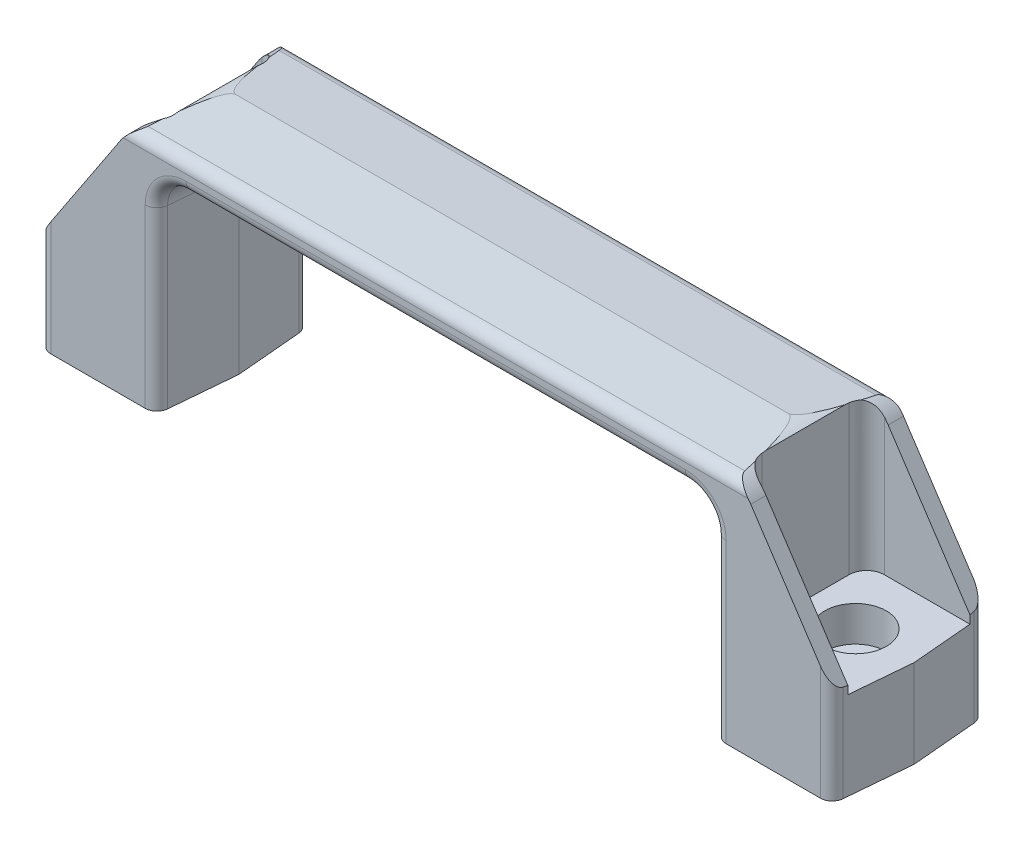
ISO-10303-21;
HEADER;
FILE_DESCRIPTION(('STEP AP214'),'2;1');
FILE_NAME('part.step','',(''),(''),'','','');
FILE_SCHEMA(('AUTOMOTIVE_DESIGN { 1 0 10303 214 1 1 1 1 }'));
ENDSEC;
DATA;
#1=APPLICATION_CONTEXT('core data for automotive mechanical design processes');
#2=APPLICATION_PROTOCOL_DEFINITION('international standard','automotive_design',2000,#1);
#3=PRODUCT_CONTEXT('',#1,'mechanical');
#4=PRODUCT('Part','Part','',(#3));
#5=PRODUCT_RELATED_PRODUCT_CATEGORY('part','',(#4));
#6=PRODUCT_DEFINITION_FORMATION('','',#4);
#7=PRODUCT_DEFINITION_CONTEXT('part definition',#1,'design');
#8=PRODUCT_DEFINITION('design','',#6,#7);
#9=PRODUCT_DEFINITION_SHAPE('','',#8);
#10=(LENGTH_UNIT() NAMED_UNIT(*) SI_UNIT(.MILLI.,.METRE.));
#11=(NAMED_UNIT(*) PLANE_ANGLE_UNIT() SI_UNIT($,.RADIAN.));
#12=(NAMED_UNIT(*) SI_UNIT($,.STERADIAN.) SOLID_ANGLE_UNIT());
#13=UNCERTAINTY_MEASURE_WITH_UNIT(LENGTH_MEASURE(1.E-05),#10,'distance_accuracy_value','');
#14=(GEOMETRIC_REPRESENTATION_CONTEXT(3) GLOBAL_UNCERTAINTY_ASSIGNED_CONTEXT((#13)) GLOBAL_UNIT_ASSIGNED_CONTEXT((#10,
#11,#12)) REPRESENTATION_CONTEXT('',''));
#15=CARTESIAN_POINT('',(0.,0.,0.));
#16=DIRECTION('',(0.,0.,1.));
#17=DIRECTION('',(1.,0.,0.));
#18=AXIS2_PLACEMENT_3D('',#15,#16,#17);
#19=CARTESIAN_POINT('',(-46.9924203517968,33.,26.));
#20=DIRECTION('',(0.,0.,-1.));
#21=DIRECTION('',(-1.,0.,0.));
#22=AXIS2_PLACEMENT_3D('',#19,#20,#21);
#23=CYLINDRICAL_SURFACE('',#22,8.);
#24=CARTESIAN_POINT('',(-46.9924203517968,33.,10.4));
#25=DIRECTION('',(0.,0.,-1.));
#26=DIRECTION('',(-1.,0.,0.));
#27=AXIS2_PLACEMENT_3D('',#24,#25,#26);
#28=CIRCLE('',#27,8.);
#29=CARTESIAN_POINT('',(-53.6635069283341,37.4154958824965,10.4));
#30=VERTEX_POINT('',#29);
#31=CARTESIAN_POINT('',(-53.,38.2828956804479,10.4));
#32=VERTEX_POINT('',#31);
#33=EDGE_CURVE('E41',#30,#32,#28,.T.);
#34=ORIENTED_EDGE('',*,*,#33,.F.);
#35=DIRECTION('',(0.,0.,-1.));
#36=VECTOR('',#35,1.);
#37=CARTESIAN_POINT('',(-53.6635069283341,37.4154958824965,26.));
#38=LINE('',#37,#36);
#39=CARTESIAN_POINT('',(-53.6635069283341,37.4154958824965,13.));
#40=VERTEX_POINT('',#39);
#41=EDGE_CURVE('E838',#40,#30,#38,.T.);
#42=ORIENTED_EDGE('',*,*,#41,.F.);
#43=CARTESIAN_POINT('',(-46.9924203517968,33.,13.));
#44=DIRECTION('',(0.,0.,1.));
#45=DIRECTION('',(-1.,0.,0.));
#46=AXIS2_PLACEMENT_3D('',#43,#44,#45);
#47=CIRCLE('',#46,8.);
#48=CARTESIAN_POINT('',(-53.213292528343,38.0299850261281,13.));
#49=VERTEX_POINT('',#48);
#50=EDGE_CURVE('E543',#49,#40,#47,.T.);
#51=ORIENTED_EDGE('',*,*,#50,.F.);
#52=CARTESIAN_POINT('',(-53.213292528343,38.0299850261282,13.));
#53=CARTESIAN_POINT('',(-53.1888717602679,38.0601883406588,13.000000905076));
#54=CARTESIAN_POINT('',(-53.1642309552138,38.0902124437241,12.999334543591));
#55=CARTESIAN_POINT('',(-53.1143796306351,38.150062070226,12.9966871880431));
#56=CARTESIAN_POINT('',(-53.0891664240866,38.1798849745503,12.9946975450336));
#57=CARTESIAN_POINT('',(-53.0381688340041,38.2393197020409,12.9894039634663));
#58=CARTESIAN_POINT('',(-53.0123815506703,38.2689281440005,12.9860900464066));
#59=CARTESIAN_POINT('',(-52.9602345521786,38.327922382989,12.9781494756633));
#60=CARTESIAN_POINT('',(-52.9338718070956,38.3573039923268,12.9735116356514));
#61=CARTESIAN_POINT('',(-52.880572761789,38.4158326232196,12.9629243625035));
#62=CARTESIAN_POINT('',(-52.8536333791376,38.4449746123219,12.9569626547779));
#63=CARTESIAN_POINT('',(-52.7991801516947,38.5030119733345,12.9437285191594));
#64=CARTESIAN_POINT('',(-52.7716632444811,38.5319014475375,12.9364428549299));
#65=CARTESIAN_POINT('',(-52.7160540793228,38.5894217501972,12.920562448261));
#66=CARTESIAN_POINT('',(-52.6879588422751,38.6180458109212,12.9119536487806));
#67=CARTESIAN_POINT('',(-52.6311929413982,38.6750225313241,12.893424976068));
#68=CARTESIAN_POINT('',(-52.6025194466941,38.7033675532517,12.8834903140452));
#69=CARTESIAN_POINT('',(-52.5461507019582,38.7582603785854,12.8628897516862));
#70=CARTESIAN_POINT('',(-52.5184636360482,38.7848341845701,12.8522706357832));
#71=CARTESIAN_POINT('',(-52.4629414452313,38.8373674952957,12.8299812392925));
#72=CARTESIAN_POINT('',(-52.4351063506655,38.8633271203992,12.8183111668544));
#73=CARTESIAN_POINT('',(-52.3793037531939,38.9146364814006,12.7939180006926));
#74=CARTESIAN_POINT('',(-52.3513361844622,38.9399858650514,12.781194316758));
#75=CARTESIAN_POINT('',(-52.2952831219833,38.9900802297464,12.7546954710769));
#76=CARTESIAN_POINT('',(-52.2671975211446,39.0148243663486,12.7409189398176));
#77=CARTESIAN_POINT('',(-52.2109228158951,39.063713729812,12.7123148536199));
#78=CARTESIAN_POINT('',(-52.1827336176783,39.0878576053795,12.6974851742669));
#79=CARTESIAN_POINT('',(-52.1262655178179,39.1355524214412,12.6667760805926));
#80=CARTESIAN_POINT('',(-52.0979865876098,39.1591014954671,12.6508938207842));
#81=CARTESIAN_POINT('',(-52.0413533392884,39.2056122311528,12.6180784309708));
#82=CARTESIAN_POINT('',(-52.0129991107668,39.2285715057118,12.6011417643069));
#83=CARTESIAN_POINT('',(-51.9562260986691,39.2739108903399,12.566225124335));
#84=CARTESIAN_POINT('',(-51.9278075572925,39.2962881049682,12.5482410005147));
#85=CARTESIAN_POINT('',(-51.8692562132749,39.3417609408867,12.5101154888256));
#86=CARTESIAN_POINT('',(-51.839129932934,39.3648110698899,12.4899096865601));
#87=CARTESIAN_POINT('',(-51.7797155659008,39.4096146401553,12.4487486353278));
#88=CARTESIAN_POINT('',(-51.7504232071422,39.4313851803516,12.4278182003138));
#89=CARTESIAN_POINT('',(-51.6927157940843,39.4736756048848,12.3852155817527));
#90=CARTESIAN_POINT('',(-51.6642950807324,39.4942119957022,12.3635674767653));
#91=CARTESIAN_POINT('',(-51.6083711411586,39.5340763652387,12.3195283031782));
#92=CARTESIAN_POINT('',(-51.5808609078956,39.5534202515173,12.297160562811));
#93=CARTESIAN_POINT('',(-51.5267946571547,39.5909416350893,12.2516833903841));
#94=CARTESIAN_POINT('',(-51.500230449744,39.6091343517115,12.2285962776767));
#95=CARTESIAN_POINT('',(-51.4480903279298,39.6443944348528,12.1816815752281));
#96=CARTESIAN_POINT('',(-51.4225052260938,39.6614762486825,12.1578750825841));
#97=CARTESIAN_POINT('',(-51.3723562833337,39.6945536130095,12.1095219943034));
#98=CARTESIAN_POINT('',(-51.3477824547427,39.7105627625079,12.0849950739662));
#99=CARTESIAN_POINT('',(-51.2996815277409,39.7415358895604,12.0352061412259));
#100=CARTESIAN_POINT('',(-51.2761439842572,39.7565124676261,12.0099621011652));
#101=CARTESIAN_POINT('',(-51.2383174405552,39.7803140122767,11.9678191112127));
#102=CARTESIAN_POINT('',(-51.2238038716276,39.7893798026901,11.9512568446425));
#103=CARTESIAN_POINT('',(-51.1954973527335,39.8069386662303,11.9180769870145));
#104=CARTESIAN_POINT('',(-51.1816954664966,39.8154404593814,11.9014716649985));
#105=CARTESIAN_POINT('',(-51.1548203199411,39.8318861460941,11.8682087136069));
#106=CARTESIAN_POINT('',(-51.141737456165,39.8398387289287,11.8515631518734));
#107=CARTESIAN_POINT('',(-51.1163100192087,39.8551986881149,11.8182191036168));
#108=CARTESIAN_POINT('',(-51.1039551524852,39.8626147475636,11.8015324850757));
#109=CARTESIAN_POINT('',(-51.0799921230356,39.8769140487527,11.7681067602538));
#110=CARTESIAN_POINT('',(-51.0683730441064,39.883805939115,11.7513791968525));
#111=CARTESIAN_POINT('',(-51.0458895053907,39.8970685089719,11.7178718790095));
#112=CARTESIAN_POINT('',(-51.0350135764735,39.9034477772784,11.7011032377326));
#113=CARTESIAN_POINT('',(-51.014023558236,39.915696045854,11.6675142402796));
#114=CARTESIAN_POINT('',(-51.0038975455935,39.9215735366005,11.6507044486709));
#115=CARTESIAN_POINT('',(-50.9844139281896,39.932828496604,11.6170337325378));
#116=CARTESIAN_POINT('',(-50.9750440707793,39.9382143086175,11.6001827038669));
#117=CARTESIAN_POINT('',(-50.957078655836,39.9484954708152,11.5664302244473));
#118=CARTESIAN_POINT('',(-50.9484706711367,39.9533989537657,11.5495378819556));
#119=CARTESIAN_POINT('',(-50.9320342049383,39.9627243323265,11.5157036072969));
#120=CARTESIAN_POINT('',(-50.9241933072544,39.9671540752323,11.49876988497));
#121=CARTESIAN_POINT('',(-50.909295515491,39.9755401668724,11.4648537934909));
#122=CARTESIAN_POINT('',(-50.9022264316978,39.9795039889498,11.4478786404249));
#123=CARTESIAN_POINT('',(-50.8888760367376,39.9869657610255,11.413880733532));
#124=CARTESIAN_POINT('',(-50.8825830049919,39.9904707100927,11.3968641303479));
#125=CARTESIAN_POINT('',(-50.8707877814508,39.9970215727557,11.3627844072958));
#126=CARTESIAN_POINT('',(-50.8652746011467,40.0000739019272,11.3457263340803));
#127=CARTESIAN_POINT('',(-50.8550412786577,40.0057257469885,11.31156489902));
#128=CARTESIAN_POINT('',(-50.8503111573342,40.008330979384,11.2944654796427));
#129=CARTESIAN_POINT('',(-50.8416458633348,40.0130939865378,11.2602221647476));
#130=CARTESIAN_POINT('',(-50.8377019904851,40.0152566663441,11.2430811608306));
#131=CARTESIAN_POINT('',(-50.8306087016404,40.019139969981,11.2087569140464));
#132=CARTESIAN_POINT('',(-50.8274521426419,40.020864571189,11.1915755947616));
#133=CARTESIAN_POINT('',(-50.8246856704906,40.0223744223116,11.1743114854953));
#134=B_SPLINE_CURVE_WITH_KNOTS('',3,(#52,#53,#54,#55,#56,#57,#58,#59,#60,#61,#62,#63,#64,#65,
#66,#67,#68,#69,#70,#71,#72,#73,#74,#75,#76,#77,#78,#79,#80,#81,#82,#83,#84,#85,#86,#87,#88,#89,
#90,#91,#92,#93,#94,#95,#96,#97,#98,#99,#100,#101,#102,#103,#104,#105,#106,#107,#108,#109,#110,
#111,#112,#113,#114,#115,#116,#117,#118,#119,#120,#121,#122,#123,#124,#125,#126,#127,#128,#129,
#130,#131,#132,#133),.UNSPECIFIED.,.F.,.F.,(4,2,2,2,2,2,2,2,2,2,2,2,2,2,2,2,2,2,2,2,2,2,2,2,2,2,
2,2,2,2,2,2,2,2,2,2,2,2,2,2,4),(0.,0.116514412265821,0.233797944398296,0.351982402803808,
0.471196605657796,0.591566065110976,0.71321271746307,0.836254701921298,0.960806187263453,
1.08024272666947,1.19965566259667,1.31913594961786,1.43877438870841,1.55866142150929,
1.67888692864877,1.79954003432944,1.92070891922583,2.04962205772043,2.1758147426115,
2.29941443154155,2.42055676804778,2.53938581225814,2.65605419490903,2.77072317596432,
2.88356258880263,2.95499839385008,3.02460556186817,3.09244269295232,3.15857309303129,
3.22306509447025,3.28599236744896,3.3474342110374,3.40747581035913,3.46620844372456,
3.52372962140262,3.5801431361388,3.63555900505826,3.69009328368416,3.74386773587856,
3.79700934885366,3.84964969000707),.UNSPECIFIED.);
#135=CARTESIAN_POINT('',(-50.8246856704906,40.0223744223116,11.1743114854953));
#136=VERTEX_POINT('',#135);
#137=EDGE_CURVE('E11',#49,#136,#134,.T.);
#138=ORIENTED_EDGE('',*,*,#137,.T.);
#139=CARTESIAN_POINT('',(-46.9924203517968,33.,91.4404184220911));
#140=DIRECTION('',(0.,0.996194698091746,0.0871557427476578));
#141=DIRECTION('',(0.,0.0871557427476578,-0.996194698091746));
#142=AXIS2_PLACEMENT_3D('',#139,#140,#141);
#143=ELLIPSE('',#142,91.7897059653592,8.);
#144=CARTESIAN_POINT('',(-50.449735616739,40.2143586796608,8.97992138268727));
#145=VERTEX_POINT('',#144);
#146=EDGE_CURVE('E467',#145,#136,#143,.T.);
#147=ORIENTED_EDGE('',*,*,#146,.F.);
#148=CARTESIAN_POINT('',(-53.,38.2828956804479,10.4));
#149=CARTESIAN_POINT('',(-52.945716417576,38.344633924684,10.3999988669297));
#150=CARTESIAN_POINT('',(-52.8904405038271,38.4055171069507,10.3985263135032));
#151=CARTESIAN_POINT('',(-52.7789401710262,38.5245049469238,10.3923577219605));
#152=CARTESIAN_POINT('',(-52.7227430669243,38.5826378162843,10.3877111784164));
#153=CARTESIAN_POINT('',(-52.6095887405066,38.6961269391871,10.3750247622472));
#154=CARTESIAN_POINT('',(-52.5526540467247,38.7515110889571,10.3670346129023));
#155=CARTESIAN_POINT('',(-52.4382481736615,38.8595015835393,10.347500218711));
#156=CARTESIAN_POINT('',(-52.3807944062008,38.9121352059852,10.3360050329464));
#157=CARTESIAN_POINT('',(-52.2655842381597,39.0146297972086,10.3093101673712));
#158=CARTESIAN_POINT('',(-52.2078403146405,39.0645169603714,10.2941579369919));
#159=CARTESIAN_POINT('',(-52.1209663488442,39.1374603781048,10.2684842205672));
#160=CARTESIAN_POINT('',(-52.0920893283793,39.1613620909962,10.2594800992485));
#161=CARTESIAN_POINT('',(-52.0343610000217,39.2084760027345,10.2405033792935));
#162=CARTESIAN_POINT('',(-52.0055103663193,39.2316911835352,10.2305361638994));
#163=CARTESIAN_POINT('',(-51.9478712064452,39.2774310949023,10.2096192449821));
#164=CARTESIAN_POINT('',(-51.9190830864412,39.2999586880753,10.1986746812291));
#165=CARTESIAN_POINT('',(-51.8616052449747,39.3443238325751,10.1757899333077));
#166=CARTESIAN_POINT('',(-51.8329156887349,39.3661641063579,10.1638546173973));
#167=CARTESIAN_POINT('',(-51.7756728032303,39.4091546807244,10.1389765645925));
#168=CARTESIAN_POINT('',(-51.7471194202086,39.4303075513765,10.1260383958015));
#169=CARTESIAN_POINT('',(-51.6901877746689,39.4719234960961,10.0991441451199));
#170=CARTESIAN_POINT('',(-51.6618092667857,39.4923889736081,10.0851923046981));
#171=CARTESIAN_POINT('',(-51.6052674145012,39.5326302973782,10.0562616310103));
#172=CARTESIAN_POINT('',(-51.5771036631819,39.552408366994,10.041286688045));
#173=CARTESIAN_POINT('',(-51.5210324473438,39.5912750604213,10.0103022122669));
#174=CARTESIAN_POINT('',(-51.4931244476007,39.6103657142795,9.99429619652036));
#175=CARTESIAN_POINT('',(-51.4376069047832,39.6478577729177,9.96124354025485));
#176=CARTESIAN_POINT('',(-51.4099967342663,39.6662610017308,9.94420002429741));
#177=CARTESIAN_POINT('',(-51.3551180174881,39.7023784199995,9.90906797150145));
#178=CARTESIAN_POINT('',(-51.3278487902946,39.7200942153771,9.89098215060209));
#179=CARTESIAN_POINT('',(-51.2736960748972,39.7548369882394,9.85376280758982));
#180=CARTESIAN_POINT('',(-51.2468118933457,39.7718653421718,9.83463158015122));
#181=CARTESIAN_POINT('',(-51.1934742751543,39.8052334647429,9.79532053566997));
#182=CARTESIAN_POINT('',(-51.1670201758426,39.8215743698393,9.77514258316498));
#183=CARTESIAN_POINT('',(-51.1145885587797,39.8535678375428,9.73373906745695));
#184=CARTESIAN_POINT('',(-51.0886104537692,39.8692212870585,9.71251493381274));
#185=CARTESIAN_POINT('',(-51.0371774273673,39.8998400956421,9.66902197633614));
#186=CARTESIAN_POINT('',(-51.0117220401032,39.9148060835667,9.64675414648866));
#187=CARTESIAN_POINT('',(-50.9613817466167,39.9440502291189,9.60117873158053));
#188=CARTESIAN_POINT('',(-50.9364965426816,39.9583287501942,9.57787170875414));
#189=CARTESIAN_POINT('',(-50.8873445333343,39.9861982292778,9.53022492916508));
#190=CARTESIAN_POINT('',(-50.8630776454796,39.99978927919,9.50588531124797));
#191=CARTESIAN_POINT('',(-50.8152107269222,40.0262840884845,9.45618251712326));
#192=CARTESIAN_POINT('',(-50.7916108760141,40.0391876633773,9.43081906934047));
#193=CARTESIAN_POINT('',(-50.7451269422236,40.0643078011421,9.37908001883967));
#194=CARTESIAN_POINT('',(-50.7222433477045,40.0765238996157,9.35270375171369));
#195=CARTESIAN_POINT('',(-50.677241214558,40.1002693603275,9.29895273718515));
#196=CARTESIAN_POINT('',(-50.6551235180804,40.111797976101,9.27157695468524));
#197=CARTESIAN_POINT('',(-50.6117026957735,40.134168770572,9.21584299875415));
#198=CARTESIAN_POINT('',(-50.5904008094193,40.1450099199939,9.18748344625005));
#199=CARTESIAN_POINT('',(-50.5486614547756,40.1660060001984,9.12980021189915));
#200=CARTESIAN_POINT('',(-50.5282256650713,40.1761596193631,9.10047483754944));
#201=CARTESIAN_POINT('',(-50.4882678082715,40.1957811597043,9.04088158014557));
#202=CARTESIAN_POINT('',(-50.4687478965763,40.205247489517,9.01061172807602));
#203=CARTESIAN_POINT('',(-50.4497356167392,40.2143586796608,8.97992138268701));
#204=B_SPLINE_CURVE_WITH_KNOTS('',3,(#148,#149,#150,#151,#152,#153,#154,#155,#156,#157,#158,
#159,#160,#161,#162,#163,#164,#165,#166,#167,#168,#169,#170,#171,#172,#173,#174,#175,#176,#177,
#178,#179,#180,#181,#182,#183,#184,#185,#186,#187,#188,#189,#190,#191,#192,#193,#194,#195,#196,
#197,#198,#199,#200,#201,#202,#203),.UNSPECIFIED.,.F.,.F.,(4,2,2,2,2,2,2,2,2,2,2,2,2,2,2,2,2,2,
2,2,2,2,2,2,2,2,2,4),(0.,0.246622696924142,0.489484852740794,0.728856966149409,
0.965021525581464,1.19827267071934,1.31391373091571,1.42894217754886,1.5433978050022,
1.65732100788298,1.77075274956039,1.883734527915,1.99630833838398,2.10851663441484,
2.22040228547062,2.33200853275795,2.44337894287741,2.55455735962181,2.66558785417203,
2.77651467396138,2.88738219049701,2.99823484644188,3.10911710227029,3.22007338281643,
3.33114802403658,3.44238522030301,3.55382897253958,3.66552303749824),.UNSPECIFIED.);
#205=EDGE_CURVE('E625',#32,#145,#204,.T.);
#206=ORIENTED_EDGE('',*,*,#205,.F.);
#207=EDGE_LOOP('',(#34,#42,#51,#138,#147,#206));
#208=FACE_BOUND('',#207,.T.);
#209=ADVANCED_FACE('F17',(#208),#23,.T.);
#210=CARTESIAN_POINT('',(-46.9924203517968,33.,26.));
#211=DIRECTION('',(0.,0.,-1.));
#212=DIRECTION('',(-1.,0.,0.));
#213=AXIS2_PLACEMENT_3D('',#210,#211,#212);
#214=CYLINDRICAL_SURFACE('',#213,8.);
#215=DIRECTION('',(0.,0.,-1.));
#216=VECTOR('',#215,1.);
#217=CARTESIAN_POINT('',(-50.,40.4131278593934,26.));
#218=LINE('',#217,#216);
#219=CARTESIAN_POINT('',(-50.,40.4131278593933,6.7079792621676));
#220=VERTEX_POINT('',#219);
#221=CARTESIAN_POINT('',(-50.,40.4131278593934,-6.70797926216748));
#222=VERTEX_POINT('',#221);
#223=EDGE_CURVE('E617',#220,#222,#218,.T.);
#224=ORIENTED_EDGE('',*,*,#223,.F.);
#225=CARTESIAN_POINT('',(-46.9924203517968,33.,91.4404184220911));
#226=DIRECTION('',(0.,0.996194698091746,0.0871557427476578));
#227=DIRECTION('',(0.,0.0871557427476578,-0.996194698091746));
#228=AXIS2_PLACEMENT_3D('',#225,#226,#227);
#229=ELLIPSE('',#228,91.7897059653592,8.);
#230=CARTESIAN_POINT('',(-46.9924203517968,41.,0.));
#231=VERTEX_POINT('',#230);
#232=EDGE_CURVE('E929',#231,#220,#229,.T.);
#233=ORIENTED_EDGE('',*,*,#232,.F.);
#234=CARTESIAN_POINT('',(-46.9924203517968,33.,-91.4404184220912));
#235=DIRECTION('',(0.,0.996194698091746,-0.0871557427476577));
#236=DIRECTION('',(0.,-0.0871557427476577,-0.996194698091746));
#237=AXIS2_PLACEMENT_3D('',#234,#235,#236);
#238=ELLIPSE('',#237,91.7897059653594,8.);
#239=EDGE_CURVE('E858',#222,#231,#238,.T.);
#240=ORIENTED_EDGE('',*,*,#239,.F.);
#241=EDGE_LOOP('',(#224,#233,#240));
#242=FACE_BOUND('',#241,.T.);
#243=ADVANCED_FACE('F589',(#242),#214,.T.);
#244=CARTESIAN_POINT('',(-46.9924203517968,33.,26.));
#245=DIRECTION('',(0.,0.,-1.));
#246=DIRECTION('',(-1.,0.,0.));
#247=AXIS2_PLACEMENT_3D('',#244,#245,#246);
#248=CYLINDRICAL_SURFACE('',#247,8.);
#249=CARTESIAN_POINT('',(-46.9924203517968,33.,-10.4));
#250=DIRECTION('',(0.,0.,1.));
#251=DIRECTION('',(1.,0.,0.));
#252=AXIS2_PLACEMENT_3D('',#249,#250,#251);
#253=CIRCLE('',#252,8.);
#254=CARTESIAN_POINT('',(-53.,38.2828956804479,-10.4));
#255=VERTEX_POINT('',#254);
#256=CARTESIAN_POINT('',(-53.6635069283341,37.4154958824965,-10.4));
#257=VERTEX_POINT('',#256);
#258=EDGE_CURVE('E613',#255,#257,#253,.T.);
#259=ORIENTED_EDGE('',*,*,#258,.F.);
#260=CARTESIAN_POINT('',(-50.4497356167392,40.2143586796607,-8.97992138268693));
#261=CARTESIAN_POINT('',(-50.4687478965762,40.2052474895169,-9.01061172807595));
#262=CARTESIAN_POINT('',(-50.4882678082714,40.1957811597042,-9.0408815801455));
#263=CARTESIAN_POINT('',(-50.5282256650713,40.176159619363,-9.10047483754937));
#264=CARTESIAN_POINT('',(-50.5486614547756,40.1660060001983,-9.12980021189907));
#265=CARTESIAN_POINT('',(-50.5904008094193,40.1450099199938,-9.18748344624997));
#266=CARTESIAN_POINT('',(-50.6117026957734,40.1341687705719,-9.21584299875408));
#267=CARTESIAN_POINT('',(-50.6551235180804,40.111797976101,-9.27157695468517));
#268=CARTESIAN_POINT('',(-50.677241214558,40.1002693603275,-9.29895273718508));
#269=CARTESIAN_POINT('',(-50.7222433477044,40.0765238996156,-9.35270375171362));
#270=CARTESIAN_POINT('',(-50.7451269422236,40.0643078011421,-9.3790800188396));
#271=CARTESIAN_POINT('',(-50.791610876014,40.0391876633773,-9.4308190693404));
#272=CARTESIAN_POINT('',(-50.8152107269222,40.0262840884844,-9.45618251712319));
#273=CARTESIAN_POINT('',(-50.8630776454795,39.99978927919,-9.5058853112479));
#274=CARTESIAN_POINT('',(-50.8873445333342,39.9861982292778,-9.53022492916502));
#275=CARTESIAN_POINT('',(-50.9364965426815,39.9583287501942,-9.57787170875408));
#276=CARTESIAN_POINT('',(-50.9613817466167,39.9440502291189,-9.60117873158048));
#277=CARTESIAN_POINT('',(-51.0117220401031,39.9148060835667,-9.6467541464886));
#278=CARTESIAN_POINT('',(-51.0371774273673,39.8998400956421,-9.66902197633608));
#279=CARTESIAN_POINT('',(-51.0886104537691,39.8692212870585,-9.71251493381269));
#280=CARTESIAN_POINT('',(-51.1145885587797,39.8535678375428,-9.7337390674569));
#281=CARTESIAN_POINT('',(-51.1670201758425,39.8215743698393,-9.77514258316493));
#282=CARTESIAN_POINT('',(-51.1934742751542,39.8052334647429,-9.79532053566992));
#283=CARTESIAN_POINT('',(-51.2468118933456,39.7718653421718,-9.83463158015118));
#284=CARTESIAN_POINT('',(-51.2736960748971,39.7548369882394,-9.85376280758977));
#285=CARTESIAN_POINT('',(-51.3278487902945,39.7200942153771,-9.89098215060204));
#286=CARTESIAN_POINT('',(-51.355118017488,39.7023784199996,-9.90906797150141));
#287=CARTESIAN_POINT('',(-51.4099967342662,39.6662610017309,-9.94420002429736));
#288=CARTESIAN_POINT('',(-51.4376069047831,39.6478577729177,-9.96124354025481));
#289=CARTESIAN_POINT('',(-51.4931244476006,39.6103657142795,-9.99429619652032));
#290=CARTESIAN_POINT('',(-51.5210324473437,39.5912750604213,-10.0103022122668));
#291=CARTESIAN_POINT('',(-51.5771036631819,39.552408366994,-10.041286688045));
#292=CARTESIAN_POINT('',(-51.6052674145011,39.5326302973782,-10.0562616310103));
#293=CARTESIAN_POINT('',(-51.6618092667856,39.4923889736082,-10.0851923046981));
#294=CARTESIAN_POINT('',(-51.6901877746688,39.4719234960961,-10.0991441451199));
#295=CARTESIAN_POINT('',(-51.7471194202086,39.4303075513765,-10.1260383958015));
#296=CARTESIAN_POINT('',(-51.7756728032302,39.4091546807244,-10.1389765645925));
#297=CARTESIAN_POINT('',(-51.8329156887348,39.3661641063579,-10.1638546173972));
#298=CARTESIAN_POINT('',(-51.8616052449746,39.3443238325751,-10.1757899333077));
#299=CARTESIAN_POINT('',(-51.9190830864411,39.2999586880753,-10.1986746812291));
#300=CARTESIAN_POINT('',(-51.9478712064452,39.2774310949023,-10.2096192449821));
#301=CARTESIAN_POINT('',(-52.0055103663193,39.2316911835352,-10.2305361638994));
#302=CARTESIAN_POINT('',(-52.0343610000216,39.2084760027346,-10.2405033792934));
#303=CARTESIAN_POINT('',(-52.0920893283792,39.1613620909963,-10.2594800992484));
#304=CARTESIAN_POINT('',(-52.1209663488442,39.1374603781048,-10.2684842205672));
#305=CARTESIAN_POINT('',(-52.2078403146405,39.0645169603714,-10.2941579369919));
#306=CARTESIAN_POINT('',(-52.2655842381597,39.0146297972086,-10.3093101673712));
#307=CARTESIAN_POINT('',(-52.3807944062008,38.9121352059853,-10.3360050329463));
#308=CARTESIAN_POINT('',(-52.4382481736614,38.8595015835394,-10.347500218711));
#309=CARTESIAN_POINT('',(-52.5526540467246,38.7515110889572,-10.3670346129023));
#310=CARTESIAN_POINT('',(-52.6095887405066,38.6961269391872,-10.3750247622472));
#311=CARTESIAN_POINT('',(-52.7227430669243,38.5826378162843,-10.3877111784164));
#312=CARTESIAN_POINT('',(-52.7789401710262,38.5245049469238,-10.3923577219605));
#313=CARTESIAN_POINT('',(-52.8904405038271,38.4055171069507,-10.3985263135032));
#314=CARTESIAN_POINT('',(-52.9457164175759,38.344633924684,-10.3999988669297));
#315=CARTESIAN_POINT('',(-53.,38.2828956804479,-10.4));
#316=B_SPLINE_CURVE_WITH_KNOTS('',3,(#260,#261,#262,#263,#264,#265,#266,#267,#268,#269,#270,
#271,#272,#273,#274,#275,#276,#277,#278,#279,#280,#281,#282,#283,#284,#285,#286,#287,#288,#289,
#290,#291,#292,#293,#294,#295,#296,#297,#298,#299,#300,#301,#302,#303,#304,#305,#306,#307,#308,
#309,#310,#311,#312,#313,#314,#315),.UNSPECIFIED.,.F.,.F.,(4,2,2,2,2,2,2,2,2,2,2,2,2,2,2,2,2,2,
2,2,2,2,2,2,2,2,2,4),(0.,0.111694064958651,0.223137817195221,0.334375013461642,
0.445449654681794,0.556405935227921,0.667288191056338,0.778140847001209,0.889008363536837,
0.999935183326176,1.1109656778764,1.22214409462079,1.33351450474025,1.44512075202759,
1.55700640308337,1.66921469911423,1.7817885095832,1.89477028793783,2.00820202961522,
2.12212523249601,2.23658085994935,2.35160930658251,2.46725036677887,2.70050151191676,
2.93666607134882,3.17603818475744,3.41890034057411,3.66552303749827),.UNSPECIFIED.);
#317=CARTESIAN_POINT('',(-50.449735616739,40.214358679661,-8.97992138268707));
#318=VERTEX_POINT('',#317);
#319=EDGE_CURVE('E610',#318,#255,#316,.T.);
#320=ORIENTED_EDGE('',*,*,#319,.F.);
#321=CARTESIAN_POINT('',(-46.9924203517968,33.,-91.4404184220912));
#322=DIRECTION('',(0.,0.996194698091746,-0.0871557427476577));
#323=DIRECTION('',(0.,-0.0871557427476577,-0.996194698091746));
#324=AXIS2_PLACEMENT_3D('',#321,#322,#323);
#325=ELLIPSE('',#324,91.7897059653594,8.);
#326=CARTESIAN_POINT('',(-50.8246856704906,40.0223744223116,-11.1743114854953));
#327=VERTEX_POINT('',#326);
#328=EDGE_CURVE('E123',#327,#318,#325,.T.);
#329=ORIENTED_EDGE('',*,*,#328,.F.);
#330=CARTESIAN_POINT('',(-50.8246856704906,40.0223744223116,-11.1743114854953));
#331=CARTESIAN_POINT('',(-50.8265290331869,40.0213684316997,-11.1858113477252));
#332=CARTESIAN_POINT('',(-50.8285445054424,40.0202676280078,-11.1972750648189));
#333=CARTESIAN_POINT('',(-50.8329230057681,40.017873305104,-11.2201837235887));
#334=CARTESIAN_POINT('',(-50.8352879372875,40.0165787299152,-11.2316281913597));
#335=CARTESIAN_POINT('',(-50.8403646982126,40.0137958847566,-11.2544982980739));
#336=CARTESIAN_POINT('',(-50.8430787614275,40.0123063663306,-11.2659232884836));
#337=CARTESIAN_POINT('',(-50.848852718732,40.0091326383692,-11.2887546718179));
#338=CARTESIAN_POINT('',(-50.8519151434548,40.0074470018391,-11.3001602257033));
#339=CARTESIAN_POINT('',(-50.8583847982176,40.0038798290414,-11.3229529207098));
#340=CARTESIAN_POINT('',(-50.8617948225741,40.0019967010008,-11.3343390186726));
#341=CARTESIAN_POINT('',(-50.8689585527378,39.9980331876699,-11.3570929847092));
#342=CARTESIAN_POINT('',(-50.8727152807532,39.9959510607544,-11.3684595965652));
#343=CARTESIAN_POINT('',(-50.8805713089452,39.9915879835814,-11.3911749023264));
#344=CARTESIAN_POINT('',(-50.8846738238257,39.9893051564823,-11.4025221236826));
#345=CARTESIAN_POINT('',(-50.8932200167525,39.9845390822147,-11.4251984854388));
#346=CARTESIAN_POINT('',(-50.8976670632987,39.9820538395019,-11.4365259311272));
#347=CARTESIAN_POINT('',(-50.9116062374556,39.9742452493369,-11.4706971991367));
#348=CARTESIAN_POINT('',(-50.9215465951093,39.968652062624,-11.4932985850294));
#349=CARTESIAN_POINT('',(-50.94276180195,39.9566482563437,-11.5384382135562));
#350=CARTESIAN_POINT('',(-50.9540656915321,39.9502194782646,-11.560957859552));
#351=CARTESIAN_POINT('',(-50.9779961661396,39.936525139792,-11.6059393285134));
#352=CARTESIAN_POINT('',(-50.9906519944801,39.9292404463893,-11.6283797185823));
#353=CARTESIAN_POINT('',(-51.0172728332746,39.9138127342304,-11.673204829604));
#354=CARTESIAN_POINT('',(-51.0312664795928,39.905649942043,-11.6955656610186));
#355=CARTESIAN_POINT('',(-51.0605486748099,39.8884417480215,-11.7402341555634));
#356=CARTESIAN_POINT('',(-51.0758646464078,39.8793761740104,-11.7625159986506));
#357=CARTESIAN_POINT('',(-51.1077760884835,39.8603355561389,-11.8070280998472));
#358=CARTESIAN_POINT('',(-51.1243973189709,39.8503401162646,-11.8292310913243));
#359=CARTESIAN_POINT('',(-51.1589016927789,39.8294109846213,-11.8735874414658));
#360=CARTESIAN_POINT('',(-51.1768085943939,39.8184568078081,-11.8957125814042));
#361=CARTESIAN_POINT('',(-51.2138679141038,39.7955773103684,-11.9399115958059));
#362=CARTESIAN_POINT('',(-51.2330419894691,39.7836314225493,-11.9619566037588));
#363=CARTESIAN_POINT('',(-51.2677679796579,39.7617844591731,-12.0006190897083));
#364=CARTESIAN_POINT('',(-51.2832183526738,39.7519919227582,-12.0173897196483));
#365=CARTESIAN_POINT('',(-51.3145929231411,39.7319517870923,-12.0506390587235));
#366=CARTESIAN_POINT('',(-51.3305205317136,39.721700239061,-12.067112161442));
#367=CARTESIAN_POINT('',(-51.3793054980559,39.6900492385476,-12.1163952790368));
#368=CARTESIAN_POINT('',(-51.4125948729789,39.6681111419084,-12.1484363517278));
#369=CARTESIAN_POINT('',(-51.4809560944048,39.6222945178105,-12.2113703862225));
#370=CARTESIAN_POINT('',(-51.5160517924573,39.5983801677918,-12.2422111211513));
#371=CARTESIAN_POINT('',(-51.5879531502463,39.5485147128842,-12.3027488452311));
#372=CARTESIAN_POINT('',(-51.6247792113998,39.522525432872,-12.332390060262));
#373=CARTESIAN_POINT('',(-51.7000550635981,39.4684145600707,-12.3905384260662));
#374=CARTESIAN_POINT('',(-51.7385209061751,39.4402529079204,-12.4189873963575));
#375=CARTESIAN_POINT('',(-51.8169972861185,39.3816866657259,-12.4747264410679));
#376=CARTESIAN_POINT('',(-51.8570194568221,39.3512400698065,-12.5019558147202));
#377=CARTESIAN_POINT('',(-51.9368204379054,39.2893111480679,-12.5542836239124));
#378=CARTESIAN_POINT('',(-51.976597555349,39.257842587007,-12.5794009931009));
#379=CARTESIAN_POINT('',(-52.0556238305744,39.194070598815,-12.6274467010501));
#380=CARTESIAN_POINT('',(-52.0948721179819,39.1617863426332,-12.650401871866));
#381=CARTESIAN_POINT('',(-52.172832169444,39.0963830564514,-12.6940953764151));
#382=CARTESIAN_POINT('',(-52.2115439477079,39.0632814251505,-12.7148596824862));
#383=CARTESIAN_POINT('',(-52.2884089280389,38.9962549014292,-12.7541804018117));
#384=CARTESIAN_POINT('',(-52.3265630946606,38.962345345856,-12.7727610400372));
#385=CARTESIAN_POINT('',(-52.4022945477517,38.8937121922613,-12.8077142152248));
#386=CARTESIAN_POINT('',(-52.4398735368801,38.8590018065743,-12.8241089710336));
#387=CARTESIAN_POINT('',(-52.5144356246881,38.7887774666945,-12.85469306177));
#388=CARTESIAN_POINT('',(-52.5514209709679,38.7532745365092,-12.8689022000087));
#389=CARTESIAN_POINT('',(-52.6247772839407,38.6814758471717,-12.8951174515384));
#390=CARTESIAN_POINT('',(-52.6611508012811,38.6451889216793,-12.9071405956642));
#391=CARTESIAN_POINT('',(-52.7332652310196,38.5718334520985,-12.9289868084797));
#392=CARTESIAN_POINT('',(-52.7690087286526,38.5347716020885,-12.9388238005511));
#393=CARTESIAN_POINT('',(-52.8398452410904,38.459877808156,-12.9563008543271));
#394=CARTESIAN_POINT('',(-52.8749405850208,38.4220505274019,-12.9639514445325));
#395=CARTESIAN_POINT('',(-52.9444634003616,38.3456378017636,-12.9770594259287));
#396=CARTESIAN_POINT('',(-52.9788926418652,38.3070551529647,-12.9825237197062));
#397=CARTESIAN_POINT('',(-53.0470658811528,38.2291434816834,-12.9912619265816));
#398=CARTESIAN_POINT('',(-53.0808107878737,38.1898156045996,-12.9945389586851));
#399=CARTESIAN_POINT('',(-53.147599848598,38.1104268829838,-12.9989097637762));
#400=CARTESIAN_POINT('',(-53.1806437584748,38.0703657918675,-13.0000027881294));
#401=CARTESIAN_POINT('',(-53.213292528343,38.0299850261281,-13.));
#402=B_SPLINE_CURVE_WITH_KNOTS('',3,(#330,#331,#332,#333,#334,#335,#336,#337,#338,#339,#340,
#341,#342,#343,#344,#345,#346,#347,#348,#349,#350,#351,#352,#353,#354,#355,#356,#357,#358,#359,
#360,#361,#362,#363,#364,#365,#366,#367,#368,#369,#370,#371,#372,#373,#374,#375,#376,#377,#378,
#379,#380,#381,#382,#383,#384,#385,#386,#387,#388,#389,#390,#391,#392,#393,#394,#395,#396,#397,
#398,#399,#400,#401),.UNSPECIFIED.,.F.,.F.,(4,2,2,2,2,2,2,2,2,2,2,2,2,2,2,2,2,2,2,2,2,2,2,2,2,2,
2,2,2,2,2,2,2,2,2,4),(0.,0.0350680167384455,0.0703346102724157,0.105839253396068,
0.141620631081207,0.177716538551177,0.214163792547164,0.250998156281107,0.288254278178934,
0.364156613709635,0.442132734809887,0.522416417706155,0.605221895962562,0.690744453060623,
0.779161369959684,0.870633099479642,0.965304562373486,1.03974552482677,1.11504600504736,
1.26841473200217,1.42580996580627,1.58758865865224,1.75407956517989,1.9255843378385,
2.09533638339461,2.26258359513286,2.42754897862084,2.59046491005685,2.75157263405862,
2.911121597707,3.06936861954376,3.22657689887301,3.38301487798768,3.53895497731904,
3.69467223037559,3.85044285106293),.UNSPECIFIED.);
#403=CARTESIAN_POINT('',(-53.213292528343,38.0299850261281,-13.));
#404=VERTEX_POINT('',#403);
#405=EDGE_CURVE('E28',#327,#404,#402,.T.);
#406=ORIENTED_EDGE('',*,*,#405,.T.);
#407=CARTESIAN_POINT('',(-46.9924203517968,33.,-13.));
#408=DIRECTION('',(0.,0.,-1.));
#409=DIRECTION('',(1.,0.,0.));
#410=AXIS2_PLACEMENT_3D('',#407,#408,#409);
#411=CIRCLE('',#410,8.);
#412=CARTESIAN_POINT('',(-53.6635069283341,37.4154958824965,-13.));
#413=VERTEX_POINT('',#412);
#414=EDGE_CURVE('E139',#413,#404,#411,.T.);
#415=ORIENTED_EDGE('',*,*,#414,.F.);
#416=DIRECTION('',(0.,0.,-1.));
#417=VECTOR('',#416,1.);
#418=CARTESIAN_POINT('',(-53.6635069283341,37.4154958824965,26.));
#419=LINE('',#418,#417);
#420=EDGE_CURVE('E741',#257,#413,#419,.T.);
#421=ORIENTED_EDGE('',*,*,#420,.F.);
#422=EDGE_LOOP('',(#259,#320,#329,#406,#415,#421));
#423=FACE_BOUND('',#422,.T.);
#424=ADVANCED_FACE('F579',(#423),#248,.T.);
#425=CARTESIAN_POINT('',(-67.5223744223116,37.5,-11.1743114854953));
#426=DIRECTION('',(0.996194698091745,0.,0.0871557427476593));
#427=DIRECTION('',(0.,-1.,0.));
#428=AXIS2_PLACEMENT_3D('',#425,#426,#427);
#429=PLANE('',#428);
#430=DIRECTION('',(0.,-1.,0.));
#431=VECTOR('',#430,1.);
#432=CARTESIAN_POINT('',(-67.5901178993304,37.5,-10.4));
#433=LINE('',#432,#431);
#434=CARTESIAN_POINT('',(-67.5901178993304,16.3746818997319,-10.4));
#435=VERTEX_POINT('',#434);
#436=CARTESIAN_POINT('',(-67.5901178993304,15.,-10.4));
#437=VERTEX_POINT('',#436);
#438=EDGE_CURVE('E618',#435,#437,#433,.T.);
#439=ORIENTED_EDGE('',*,*,#438,.F.);
#440=DIRECTION('',(-0.0864098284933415,-0.130551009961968,0.987668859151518));
#441=VECTOR('',#440,1.);
#442=CARTESIAN_POINT('',(-67.2852166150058,16.8353374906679,-13.8850376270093));
#443=LINE('',#442,#441);
#444=CARTESIAN_POINT('',(-67.5223744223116,16.4770311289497,-11.1743114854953));
#445=VERTEX_POINT('',#444);
#446=EDGE_CURVE('E1043',#445,#435,#443,.T.);
#447=ORIENTED_EDGE('',*,*,#446,.F.);
#448=DIRECTION('',(0.,-1.,0.));
#449=VECTOR('',#448,1.);
#450=CARTESIAN_POINT('',(-67.5223744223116,37.5,-11.1743114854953));
#451=LINE('',#450,#449);
#452=CARTESIAN_POINT('',(-67.5223744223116,0.,-11.1743114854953));
#453=VERTEX_POINT('',#452);
#454=EDGE_CURVE('E842',#445,#453,#451,.T.);
#455=ORIENTED_EDGE('',*,*,#454,.T.);
#456=DIRECTION('',(-0.0871557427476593,0.,0.996194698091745));
#457=VECTOR('',#456,1.);
#458=CARTESIAN_POINT('',(-67.5223744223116,0.,-11.1743114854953));
#459=LINE('',#458,#457);
#460=CARTESIAN_POINT('',(-68.5,0.,0.));
#461=VERTEX_POINT('',#460);
#462=EDGE_CURVE('E802',#453,#461,#459,.T.);
#463=ORIENTED_EDGE('',*,*,#462,.T.);
#464=DIRECTION('',(0.,-1.,0.));
#465=VECTOR('',#464,1.);
#466=CARTESIAN_POINT('',(-68.5,37.5,0.));
#467=LINE('',#466,#465);
#468=CARTESIAN_POINT('',(-68.5,15.,-1.11022302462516E-13));
#469=VERTEX_POINT('',#468);
#470=EDGE_CURVE('E762',#469,#461,#467,.T.);
#471=ORIENTED_EDGE('',*,*,#470,.F.);
#472=DIRECTION('',(-0.0871557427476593,0.,0.996194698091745));
#473=VECTOR('',#472,1.);
#474=CARTESIAN_POINT('',(-67.5223744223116,15.,-11.1743114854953));
#475=LINE('',#474,#473);
#476=EDGE_CURVE('E879',#437,#469,#475,.T.);
#477=ORIENTED_EDGE('',*,*,#476,.F.);
#478=EDGE_LOOP('',(#439,#447,#455,#463,#471,#477));
#479=FACE_BOUND('',#478,.T.);
#480=ADVANCED_FACE('F588',(#479),#429,.F.);
#481=CARTESIAN_POINT('',(-68.5,37.5,0.));
#482=DIRECTION('',(0.996194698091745,0.,-0.0871557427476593));
#483=DIRECTION('',(0.,-1.,0.));
#484=AXIS2_PLACEMENT_3D('',#481,#482,#483);
#485=PLANE('',#484);
#486=DIRECTION('',(0.,1.,0.));
#487=VECTOR('',#486,1.);
#488=CARTESIAN_POINT('',(-67.5901178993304,37.5,10.4));
#489=LINE('',#488,#487);
#490=CARTESIAN_POINT('',(-67.5901178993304,15.,10.4));
#491=VERTEX_POINT('',#490);
#492=CARTESIAN_POINT('',(-67.5901178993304,16.3746818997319,10.4));
#493=VERTEX_POINT('',#492);
#494=EDGE_CURVE('E716',#491,#493,#489,.T.);
#495=ORIENTED_EDGE('',*,*,#494,.F.);
#496=DIRECTION('',(0.0871557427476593,0.,0.996194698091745));
#497=VECTOR('',#496,1.);
#498=CARTESIAN_POINT('',(-68.5,15.,0.));
#499=LINE('',#498,#497);
#500=EDGE_CURVE('E1012',#469,#491,#499,.T.);
#501=ORIENTED_EDGE('',*,*,#500,.F.);
#502=ORIENTED_EDGE('',*,*,#470,.T.);
#503=DIRECTION('',(0.0871557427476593,0.,0.996194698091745));
#504=VECTOR('',#503,1.);
#505=CARTESIAN_POINT('',(-68.5,0.,0.));
#506=LINE('',#505,#504);
#507=CARTESIAN_POINT('',(-67.5223744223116,0.,11.1743114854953));
#508=VERTEX_POINT('',#507);
#509=EDGE_CURVE('E564',#461,#508,#506,.T.);
#510=ORIENTED_EDGE('',*,*,#509,.T.);
#511=DIRECTION('',(0.,-1.,0.));
#512=VECTOR('',#511,1.);
#513=CARTESIAN_POINT('',(-67.5223744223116,37.5,11.1743114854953));
#514=LINE('',#513,#512);
#515=CARTESIAN_POINT('',(-67.5223744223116,16.4770311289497,11.1743114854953));
#516=VERTEX_POINT('',#515);
#517=EDGE_CURVE('E751',#516,#508,#514,.T.);
#518=ORIENTED_EDGE('',*,*,#517,.F.);
#519=DIRECTION('',(0.0864098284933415,0.130551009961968,0.987668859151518));
#520=VECTOR('',#519,1.);
#521=CARTESIAN_POINT('',(-68.24617996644,15.383480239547,2.90117625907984));
#522=LINE('',#521,#520);
#523=EDGE_CURVE('E767',#493,#516,#522,.T.);
#524=ORIENTED_EDGE('',*,*,#523,.F.);
#525=EDGE_LOOP('',(#495,#501,#502,#510,#518,#524));
#526=FACE_BOUND('',#525,.T.);
#527=ADVANCED_FACE('F1337',(#526),#485,.F.);
#528=CARTESIAN_POINT('',(68.5,41.,0.));
#529=DIRECTION('',(0.,-0.996194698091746,-0.0871557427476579));
#530=DIRECTION('',(0.,0.0871557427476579,-0.996194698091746));
#531=AXIS2_PLACEMENT_3D('',#528,#529,#530);
#532=PLANE('',#531);
#533=CARTESIAN_POINT('',(-53.,40.3525838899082,7.4));
#534=DIRECTION('',(0.,0.996194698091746,0.0871557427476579));
#535=DIRECTION('',(0.,-0.0871557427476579,0.996194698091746));
#536=AXIS2_PLACEMENT_3D('',#533,#534,#535);
#537=ELLIPSE('',#536,3.01145951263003,3.);
#538=CARTESIAN_POINT('',(-50.,40.3525838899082,7.4));
#539=VERTEX_POINT('',#538);
#540=EDGE_CURVE('E718',#145,#539,#537,.T.);
#541=ORIENTED_EDGE('',*,*,#540,.F.);
#542=ORIENTED_EDGE('',*,*,#146,.T.);
#543=DIRECTION('',(-1.,0.,0.));
#544=VECTOR('',#543,1.);
#545=CARTESIAN_POINT('',(68.5,40.0223744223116,11.1743114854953));
#546=LINE('',#545,#544);
#547=CARTESIAN_POINT('',(50.8246856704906,40.0223744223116,11.1743114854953));
#548=VERTEX_POINT('',#547);
#549=EDGE_CURVE('E462',#548,#136,#546,.T.);
#550=ORIENTED_EDGE('',*,*,#549,.F.);
#551=CARTESIAN_POINT('',(46.9924203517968,33.,91.4404184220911));
#552=DIRECTION('',(0.,0.996194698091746,0.0871557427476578));
#553=DIRECTION('',(0.,0.0871557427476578,-0.996194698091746));
#554=AXIS2_PLACEMENT_3D('',#551,#552,#553);
#555=ELLIPSE('',#554,91.7897059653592,8.);
#556=CARTESIAN_POINT('',(50.449735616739,40.2143586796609,8.97992138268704));
#557=VERTEX_POINT('',#556);
#558=EDGE_CURVE('E458',#548,#557,#555,.T.);
#559=ORIENTED_EDGE('',*,*,#558,.T.);
#560=CARTESIAN_POINT('',(53.,40.3525838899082,7.4));
#561=DIRECTION('',(0.,0.996194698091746,0.0871557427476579));
#562=DIRECTION('',(0.,-0.0871557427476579,0.996194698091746));
#563=AXIS2_PLACEMENT_3D('',#560,#561,#562);
#564=ELLIPSE('',#563,3.01145951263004,3.);
#565=CARTESIAN_POINT('',(50.,40.3525838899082,7.4));
#566=VERTEX_POINT('',#565);
#567=EDGE_CURVE('E440',#566,#557,#564,.T.);
#568=ORIENTED_EDGE('',*,*,#567,.F.);
#569=DIRECTION('',(0.,-0.0871557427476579,0.996194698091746));
#570=VECTOR('',#569,1.);
#571=CARTESIAN_POINT('',(50.,41.,0.));
#572=LINE('',#571,#570);
#573=CARTESIAN_POINT('',(50.,40.4131278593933,6.70797926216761));
#574=VERTEX_POINT('',#573);
#575=EDGE_CURVE('E945',#574,#566,#572,.T.);
#576=ORIENTED_EDGE('',*,*,#575,.F.);
#577=CARTESIAN_POINT('',(46.9924203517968,33.,91.4404184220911));
#578=DIRECTION('',(0.,0.996194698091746,0.0871557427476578));
#579=DIRECTION('',(0.,0.0871557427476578,-0.996194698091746));
#580=AXIS2_PLACEMENT_3D('',#577,#578,#579);
#581=ELLIPSE('',#580,91.7897059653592,8.);
#582=CARTESIAN_POINT('',(46.9924203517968,41.,0.));
#583=VERTEX_POINT('',#582);
#584=EDGE_CURVE('E468',#574,#583,#581,.T.);
#585=ORIENTED_EDGE('',*,*,#584,.T.);
#586=DIRECTION('',(-1.,0.,0.));
#587=VECTOR('',#586,1.);
#588=CARTESIAN_POINT('',(68.5,41.,0.));
#589=LINE('',#588,#587);
#590=EDGE_CURVE('E925',#583,#231,#589,.T.);
#591=ORIENTED_EDGE('',*,*,#590,.T.);
#592=ORIENTED_EDGE('',*,*,#232,.T.);
#593=DIRECTION('',(0.,0.0871557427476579,-0.996194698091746));
#594=VECTOR('',#593,1.);
#595=CARTESIAN_POINT('',(-50.,41.,0.));
#596=LINE('',#595,#594);
#597=EDGE_CURVE('E778',#539,#220,#596,.T.);
#598=ORIENTED_EDGE('',*,*,#597,.F.);
#599=EDGE_LOOP('',(#541,#542,#550,#559,#568,#576,#585,#591,#592,#598));
#600=FACE_BOUND('',#599,.T.);
#601=ADVANCED_FACE('F460',(#600),#532,.F.);
#602=CARTESIAN_POINT('',(-68.5,15.,26.));
#603=DIRECTION('',(-0.833885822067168,0.551936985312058,0.));
#604=DIRECTION('',(0.,0.,1.));
#605=AXIS2_PLACEMENT_3D('',#602,#603,#604);
#606=PLANE('',#605);
#607=ORIENTED_EDGE('',*,*,#446,.T.);
#608=DIRECTION('',(0.551936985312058,0.833885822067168,0.));
#609=VECTOR('',#608,1.);
#610=CARTESIAN_POINT('',(-68.5,15.,-10.4));
#611=LINE('',#610,#609);
#612=EDGE_CURVE('E745',#435,#257,#611,.T.);
#613=ORIENTED_EDGE('',*,*,#612,.T.);
#614=ORIENTED_EDGE('',*,*,#420,.T.);
#615=DIRECTION('',(-0.551936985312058,-0.833885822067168,0.));
#616=VECTOR('',#615,1.);
#617=CARTESIAN_POINT('',(-16.6533295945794,93.3317743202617,-13.));
#618=LINE('',#617,#616);
#619=CARTESIAN_POINT('',(-65.5299850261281,19.4872031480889,-13.));
#620=VERTEX_POINT('',#619);
#621=EDGE_CURVE('E746',#413,#620,#618,.T.);
#622=ORIENTED_EDGE('',*,*,#621,.T.);
#623=CARTESIAN_POINT('',(-65.5299850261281,19.4872031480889,-11.));
#624=DIRECTION('',(-0.833885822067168,0.551936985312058,0.));
#625=DIRECTION('',(-0.551936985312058,-0.833885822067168,0.));
#626=AXIS2_PLACEMENT_3D('',#623,#624,#625);
#627=ELLIPSE('',#626,3.62360206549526,2.);
#628=EDGE_CURVE('E869',#620,#445,#627,.T.);
#629=ORIENTED_EDGE('',*,*,#628,.T.);
#630=EDGE_LOOP('',(#607,#613,#614,#622,#629));
#631=FACE_BOUND('',#630,.T.);
#632=ADVANCED_FACE('F591',(#631),#606,.T.);
#633=CARTESIAN_POINT('',(-68.5,15.,26.));
#634=DIRECTION('',(-0.833885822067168,0.551936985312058,0.));
#635=DIRECTION('',(0.,0.,1.));
#636=AXIS2_PLACEMENT_3D('',#633,#634,#635);
#637=PLANE('',#636);
#638=ORIENTED_EDGE('',*,*,#41,.T.);
#639=DIRECTION('',(-0.551936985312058,-0.833885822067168,0.));
#640=VECTOR('',#639,1.);
#641=CARTESIAN_POINT('',(-68.5,15.,10.4));
#642=LINE('',#641,#640);
#643=EDGE_CURVE('E834',#30,#493,#642,.T.);
#644=ORIENTED_EDGE('',*,*,#643,.T.);
#645=ORIENTED_EDGE('',*,*,#523,.T.);
#646=CARTESIAN_POINT('',(-65.5299850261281,19.4872031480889,11.));
#647=DIRECTION('',(-0.833885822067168,0.551936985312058,0.));
#648=DIRECTION('',(-0.551936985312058,-0.833885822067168,0.));
#649=AXIS2_PLACEMENT_3D('',#646,#647,#648);
#650=ELLIPSE('',#649,3.6236020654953,2.);
#651=CARTESIAN_POINT('',(-65.5299850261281,19.4872031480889,13.));
#652=VERTEX_POINT('',#651);
#653=EDGE_CURVE('E763',#516,#652,#650,.T.);
#654=ORIENTED_EDGE('',*,*,#653,.T.);
#655=DIRECTION('',(0.551936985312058,0.833885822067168,0.));
#656=VECTOR('',#655,1.);
#657=CARTESIAN_POINT('',(-16.1654758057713,94.0688409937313,13.));
#658=LINE('',#657,#656);
#659=EDGE_CURVE('E768',#652,#40,#658,.T.);
#660=ORIENTED_EDGE('',*,*,#659,.T.);
#661=EDGE_LOOP('',(#638,#644,#645,#654,#660));
#662=FACE_BOUND('',#661,.T.);
#663=ADVANCED_FACE('F655',(#662),#637,.T.);
#664=CARTESIAN_POINT('',(46.9924203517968,33.,26.));
#665=DIRECTION('',(0.,0.,-1.));
#666=DIRECTION('',(-1.,0.,0.));
#667=AXIS2_PLACEMENT_3D('',#664,#665,#666);
#668=CYLINDRICAL_SURFACE('',#667,8.);
#669=DIRECTION('',(0.,0.,1.));
#670=VECTOR('',#669,1.);
#671=CARTESIAN_POINT('',(50.,40.4131278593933,26.));
#672=LINE('',#671,#670);
#673=CARTESIAN_POINT('',(50.,40.4131278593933,-6.70797926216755));
#674=VERTEX_POINT('',#673);
#675=EDGE_CURVE('E908',#674,#574,#672,.T.);
#676=ORIENTED_EDGE('',*,*,#675,.F.);
#677=CARTESIAN_POINT('',(46.9924203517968,33.,-91.4404184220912));
#678=DIRECTION('',(0.,0.996194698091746,-0.0871557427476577));
#679=DIRECTION('',(0.,-0.0871557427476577,-0.996194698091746));
#680=AXIS2_PLACEMENT_3D('',#677,#678,#679);
#681=ELLIPSE('',#680,91.7897059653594,8.);
#682=EDGE_CURVE('E1009',#583,#674,#681,.T.);
#683=ORIENTED_EDGE('',*,*,#682,.F.);
#684=ORIENTED_EDGE('',*,*,#584,.F.);
#685=EDGE_LOOP('',(#676,#683,#684));
#686=FACE_BOUND('',#685,.T.);
#687=ADVANCED_FACE('F493',(#686),#668,.T.);
#688=CARTESIAN_POINT('',(46.9924203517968,33.,26.));
#689=DIRECTION('',(0.,0.,-1.));
#690=DIRECTION('',(-1.,0.,0.));
#691=AXIS2_PLACEMENT_3D('',#688,#689,#690);
#692=CYLINDRICAL_SURFACE('',#691,8.);
#693=CARTESIAN_POINT('',(50.4497356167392,40.2143586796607,8.97992138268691));
#694=CARTESIAN_POINT('',(50.4687478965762,40.2052474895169,9.01061172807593));
#695=CARTESIAN_POINT('',(50.4882678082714,40.1957811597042,9.04088158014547));
#696=CARTESIAN_POINT('',(50.5282256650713,40.176159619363,9.10047483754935));
#697=CARTESIAN_POINT('',(50.5486614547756,40.1660060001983,9.12980021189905));
#698=CARTESIAN_POINT('',(50.5904008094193,40.1450099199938,9.18748344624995));
#699=CARTESIAN_POINT('',(50.6117026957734,40.1341687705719,9.21584299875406));
#700=CARTESIAN_POINT('',(50.6551235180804,40.111797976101,9.27157695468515));
#701=CARTESIAN_POINT('',(50.677241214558,40.1002693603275,9.29895273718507));
#702=CARTESIAN_POINT('',(50.7222433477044,40.0765238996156,9.35270375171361));
#703=CARTESIAN_POINT('',(50.7451269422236,40.0643078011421,9.37908001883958));
#704=CARTESIAN_POINT('',(50.791610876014,40.0391876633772,9.43081906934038));
#705=CARTESIAN_POINT('',(50.8152107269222,40.0262840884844,9.45618251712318));
#706=CARTESIAN_POINT('',(50.8630776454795,39.99978927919,9.50588531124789));
#707=CARTESIAN_POINT('',(50.8873445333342,39.9861982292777,9.530224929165));
#708=CARTESIAN_POINT('',(50.9364965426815,39.9583287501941,9.57787170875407));
#709=CARTESIAN_POINT('',(50.9613817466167,39.9440502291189,9.60117873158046));
#710=CARTESIAN_POINT('',(51.0117220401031,39.9148060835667,9.64675414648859));
#711=CARTESIAN_POINT('',(51.0371774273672,39.8998400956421,9.66902197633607));
#712=CARTESIAN_POINT('',(51.0886104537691,39.8692212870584,9.71251493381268));
#713=CARTESIAN_POINT('',(51.1145885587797,39.8535678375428,9.73373906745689));
#714=CARTESIAN_POINT('',(51.1670201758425,39.8215743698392,9.77514258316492));
#715=CARTESIAN_POINT('',(51.1934742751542,39.8052334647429,9.79532053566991));
#716=CARTESIAN_POINT('',(51.2468118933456,39.7718653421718,9.83463158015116));
#717=CARTESIAN_POINT('',(51.2736960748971,39.7548369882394,9.85376280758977));
#718=CARTESIAN_POINT('',(51.3278487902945,39.7200942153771,9.89098215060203));
#719=CARTESIAN_POINT('',(51.355118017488,39.7023784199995,9.9090679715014));
#720=CARTESIAN_POINT('',(51.4099967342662,39.6662610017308,9.94420002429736));
#721=CARTESIAN_POINT('',(51.4376069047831,39.6478577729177,9.96124354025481));
#722=CARTESIAN_POINT('',(51.4931244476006,39.6103657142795,9.99429619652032));
#723=CARTESIAN_POINT('',(51.5210324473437,39.5912750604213,10.0103022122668));
#724=CARTESIAN_POINT('',(51.5771036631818,39.552408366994,10.041286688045));
#725=CARTESIAN_POINT('',(51.6052674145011,39.5326302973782,10.0562616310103));
#726=CARTESIAN_POINT('',(51.6618092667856,39.4923889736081,10.0851923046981));
#727=CARTESIAN_POINT('',(51.6901877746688,39.4719234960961,10.0991441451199));
#728=CARTESIAN_POINT('',(51.7471194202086,39.4303075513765,10.1260383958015));
#729=CARTESIAN_POINT('',(51.7756728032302,39.4091546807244,10.1389765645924));
#730=CARTESIAN_POINT('',(51.8329156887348,39.3661641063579,10.1638546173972));
#731=CARTESIAN_POINT('',(51.8616052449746,39.3443238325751,10.1757899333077));
#732=CARTESIAN_POINT('',(51.9190830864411,39.2999586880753,10.1986746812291));
#733=CARTESIAN_POINT('',(51.9478712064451,39.2774310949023,10.2096192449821));
#734=CARTESIAN_POINT('',(52.0055103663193,39.2316911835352,10.2305361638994));
#735=CARTESIAN_POINT('',(52.0343610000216,39.2084760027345,10.2405033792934));
#736=CARTESIAN_POINT('',(52.0920893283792,39.1613620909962,10.2594800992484));
#737=CARTESIAN_POINT('',(52.1209663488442,39.1374603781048,10.2684842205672));
#738=CARTESIAN_POINT('',(52.2078403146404,39.0645169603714,10.2941579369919));
#739=CARTESIAN_POINT('',(52.2655842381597,39.0146297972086,10.3093101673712));
#740=CARTESIAN_POINT('',(52.3807944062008,38.9121352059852,10.3360050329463));
#741=CARTESIAN_POINT('',(52.4382481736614,38.8595015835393,10.347500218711));
#742=CARTESIAN_POINT('',(52.5526540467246,38.7515110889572,10.3670346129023));
#743=CARTESIAN_POINT('',(52.6095887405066,38.6961269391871,10.3750247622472));
#744=CARTESIAN_POINT('',(52.7227430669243,38.5826378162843,10.3877111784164));
#745=CARTESIAN_POINT('',(52.7789401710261,38.5245049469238,10.3923577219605));
#746=CARTESIAN_POINT('',(52.8904405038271,38.4055171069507,10.3985263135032));
#747=CARTESIAN_POINT('',(52.9457164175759,38.344633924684,10.3999988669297));
#748=CARTESIAN_POINT('',(53.,38.2828956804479,10.4));
#749=B_SPLINE_CURVE_WITH_KNOTS('',3,(#693,#694,#695,#696,#697,#698,#699,#700,#701,#702,#703,
#704,#705,#706,#707,#708,#709,#710,#711,#712,#713,#714,#715,#716,#717,#718,#719,#720,#721,#722,
#723,#724,#725,#726,#727,#728,#729,#730,#731,#732,#733,#734,#735,#736,#737,#738,#739,#740,#741,
#742,#743,#744,#745,#746,#747,#748),.UNSPECIFIED.,.F.,.F.,(4,2,2,2,2,2,2,2,2,2,2,2,2,2,2,2,2,2,
2,2,2,2,2,2,2,2,2,4),(0.,0.111694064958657,0.223137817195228,0.334375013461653,
0.445449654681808,0.556405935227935,0.66728819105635,0.778140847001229,0.889008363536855,
0.999935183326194,1.11096567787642,1.22214409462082,1.33351450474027,1.44512075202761,
1.55700640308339,1.66921469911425,1.78178850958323,1.89477028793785,2.00820202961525,
2.12212523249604,2.23658085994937,2.35160930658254,2.46725036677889,2.70050151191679,
2.93666607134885,3.17603818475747,3.41890034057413,3.66552303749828),.UNSPECIFIED.);
#750=CARTESIAN_POINT('',(53.,38.2828956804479,10.4));
#751=VERTEX_POINT('',#750);
#752=EDGE_CURVE('E445',#557,#751,#749,.T.);
#753=ORIENTED_EDGE('',*,*,#752,.F.);
#754=ORIENTED_EDGE('',*,*,#558,.F.);
#755=CARTESIAN_POINT('',(50.8246856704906,40.0223744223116,11.1743114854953));
#756=CARTESIAN_POINT('',(50.8265290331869,40.0213684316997,11.1858113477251));
#757=CARTESIAN_POINT('',(50.8285445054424,40.0202676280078,11.1972750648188));
#758=CARTESIAN_POINT('',(50.832923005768,40.017873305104,11.2201837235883));
#759=CARTESIAN_POINT('',(50.8352879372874,40.0165787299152,11.2316281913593));
#760=CARTESIAN_POINT('',(50.8403646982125,40.0137958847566,11.2544982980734));
#761=CARTESIAN_POINT('',(50.8430787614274,40.0123063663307,11.2659232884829));
#762=CARTESIAN_POINT('',(50.8488527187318,40.0091326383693,11.2887546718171));
#763=CARTESIAN_POINT('',(50.8519151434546,40.0074470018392,11.3001602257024));
#764=CARTESIAN_POINT('',(50.8583847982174,40.0038798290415,11.3229529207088));
#765=CARTESIAN_POINT('',(50.8617948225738,40.0019967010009,11.3343390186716));
#766=CARTESIAN_POINT('',(50.8689585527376,39.99803318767,11.3570929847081));
#767=CARTESIAN_POINT('',(50.8727152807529,39.9959510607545,11.368459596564));
#768=CARTESIAN_POINT('',(50.880571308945,39.9915879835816,11.3911749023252));
#769=CARTESIAN_POINT('',(50.8846738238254,39.9893051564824,11.4025221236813));
#770=CARTESIAN_POINT('',(50.8932200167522,39.9845390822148,11.4251984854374));
#771=CARTESIAN_POINT('',(50.8976670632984,39.9820538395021,11.4365259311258));
#772=CARTESIAN_POINT('',(50.9116062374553,39.974245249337,11.4706971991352));
#773=CARTESIAN_POINT('',(50.921546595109,39.9686520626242,11.4932985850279));
#774=CARTESIAN_POINT('',(50.9427618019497,39.9566482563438,11.5384382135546));
#775=CARTESIAN_POINT('',(50.9540656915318,39.9502194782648,11.5609578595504));
#776=CARTESIAN_POINT('',(50.9779961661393,39.9365251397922,11.6059393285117));
#777=CARTESIAN_POINT('',(50.9906519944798,39.9292404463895,11.6283797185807));
#778=CARTESIAN_POINT('',(51.0172728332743,39.9138127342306,11.6732048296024));
#779=CARTESIAN_POINT('',(51.0312664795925,39.9056499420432,11.6955656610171));
#780=CARTESIAN_POINT('',(51.0605486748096,39.8884417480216,11.740234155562));
#781=CARTESIAN_POINT('',(51.0758646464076,39.8793761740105,11.7625159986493));
#782=CARTESIAN_POINT('',(51.1077760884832,39.8603355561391,11.807028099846));
#783=CARTESIAN_POINT('',(51.1243973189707,39.8503401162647,11.8292310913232));
#784=CARTESIAN_POINT('',(51.1589016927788,39.8294109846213,11.873587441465));
#785=CARTESIAN_POINT('',(51.1768085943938,39.8184568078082,11.8957125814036));
#786=CARTESIAN_POINT('',(51.2138679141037,39.7955773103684,11.9399115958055));
#787=CARTESIAN_POINT('',(51.233041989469,39.7836314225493,11.9619566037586));
#788=CARTESIAN_POINT('',(51.2677679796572,39.7617844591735,12.0006190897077));
#789=CARTESIAN_POINT('',(51.2832183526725,39.751991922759,12.0173897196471));
#790=CARTESIAN_POINT('',(51.3145929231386,39.7319517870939,12.0506390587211));
#791=CARTESIAN_POINT('',(51.3305205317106,39.721700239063,12.067112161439));
#792=CARTESIAN_POINT('',(51.3793054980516,39.6900492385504,12.1163952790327));
#793=CARTESIAN_POINT('',(51.4125948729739,39.6681111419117,12.148436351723));
#794=CARTESIAN_POINT('',(51.4809560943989,39.6222945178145,12.2113703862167));
#795=CARTESIAN_POINT('',(51.5160517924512,39.598380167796,12.2422111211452));
#796=CARTESIAN_POINT('',(51.5879531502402,39.5485147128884,12.3027488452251));
#797=CARTESIAN_POINT('',(51.624779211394,39.5225254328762,12.3323900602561));
#798=CARTESIAN_POINT('',(51.7000550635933,39.4684145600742,12.3905384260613));
#799=CARTESIAN_POINT('',(51.738520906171,39.4402529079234,12.4189873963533));
#800=CARTESIAN_POINT('',(51.8169972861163,39.3816866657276,12.4747264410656));
#801=CARTESIAN_POINT('',(51.857019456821,39.3512400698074,12.5019558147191));
#802=CARTESIAN_POINT('',(51.9368204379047,39.2893111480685,12.5542836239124));
#803=CARTESIAN_POINT('',(51.9765975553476,39.2578425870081,12.5794009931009));
#804=CARTESIAN_POINT('',(52.0556238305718,39.1940705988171,12.6274467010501));
#805=CARTESIAN_POINT('',(52.0948721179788,39.1617863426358,12.650401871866));
#806=CARTESIAN_POINT('',(52.1728321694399,39.0963830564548,12.6940953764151));
#807=CARTESIAN_POINT('',(52.2115439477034,39.0632814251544,12.7148596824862));
#808=CARTESIAN_POINT('',(52.2884089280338,38.9962549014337,12.7541804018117));
#809=CARTESIAN_POINT('',(52.3265630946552,38.9623453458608,12.7727610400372));
#810=CARTESIAN_POINT('',(52.4022945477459,38.8937121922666,12.8077142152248));
#811=CARTESIAN_POINT('',(52.4398735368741,38.8590018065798,12.8241089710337));
#812=CARTESIAN_POINT('',(52.514435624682,38.7887774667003,12.8546930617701));
#813=CARTESIAN_POINT('',(52.5514209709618,38.7532745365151,12.8689022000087));
#814=CARTESIAN_POINT('',(52.6247772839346,38.6814758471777,12.8951174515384));
#815=CARTESIAN_POINT('',(52.6611508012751,38.6451889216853,12.9071405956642));
#816=CARTESIAN_POINT('',(52.7332652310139,38.5718334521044,12.9289868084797));
#817=CARTESIAN_POINT('',(52.7690087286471,38.5347716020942,12.9388238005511));
#818=CARTESIAN_POINT('',(52.8398452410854,38.4598778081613,12.9563008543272));
#819=CARTESIAN_POINT('',(52.8749405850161,38.4220505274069,12.9639514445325));
#820=CARTESIAN_POINT('',(52.9444634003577,38.345637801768,12.9770594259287));
#821=CARTESIAN_POINT('',(52.9788926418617,38.3070551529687,12.9825237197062));
#822=CARTESIAN_POINT('',(53.0470658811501,38.2291434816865,12.9912619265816));
#823=CARTESIAN_POINT('',(53.0808107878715,38.1898156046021,12.9945389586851));
#824=CARTESIAN_POINT('',(53.1475998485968,38.1104268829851,12.9989097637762));
#825=CARTESIAN_POINT('',(53.1806437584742,38.0703657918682,13.0000027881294));
#826=CARTESIAN_POINT('',(53.213292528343,38.0299850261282,13.));
#827=B_SPLINE_CURVE_WITH_KNOTS('',3,(#755,#756,#757,#758,#759,#760,#761,#762,#763,#764,#765,
#766,#767,#768,#769,#770,#771,#772,#773,#774,#775,#776,#777,#778,#779,#780,#781,#782,#783,#784,
#785,#786,#787,#788,#789,#790,#791,#792,#793,#794,#795,#796,#797,#798,#799,#800,#801,#802,#803,
#804,#805,#806,#807,#808,#809,#810,#811,#812,#813,#814,#815,#816,#817,#818,#819,#820,#821,#822,
#823,#824,#825,#826),.UNSPECIFIED.,.F.,.F.,(4,2,2,2,2,2,2,2,2,2,2,2,2,2,2,2,2,2,2,2,2,2,2,2,2,2,
2,2,2,2,2,2,2,2,2,4),(0.,0.0350680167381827,0.0703346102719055,0.105839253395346,
0.141620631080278,0.177716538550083,0.214163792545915,0.250998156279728,0.288254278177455,
0.364156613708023,0.442132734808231,0.522416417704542,0.605221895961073,0.69074445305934,
0.779161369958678,0.870633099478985,0.965304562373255,1.03974552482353,1.11504600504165,
1.26841473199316,1.42580996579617,1.58758865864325,1.75407956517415,1.92558433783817,
2.09533638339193,2.26258359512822,2.42754897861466,2.59046491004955,2.75157263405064,
2.91112159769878,3.06936861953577,3.22657689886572,3.38301487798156,3.53895497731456,
3.69467223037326,3.85044285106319),.UNSPECIFIED.);
#828=CARTESIAN_POINT('',(53.213292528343,38.0299850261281,13.));
#829=VERTEX_POINT('',#828);
#830=EDGE_CURVE('E514',#548,#829,#827,.T.);
#831=ORIENTED_EDGE('',*,*,#830,.T.);
#832=CARTESIAN_POINT('',(46.9924203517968,33.,13.));
#833=DIRECTION('',(0.,0.,1.));
#834=DIRECTION('',(-1.,0.,0.));
#835=AXIS2_PLACEMENT_3D('',#832,#833,#834);
#836=CIRCLE('',#835,8.);
#837=CARTESIAN_POINT('',(53.6635069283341,37.4154958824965,13.));
#838=VERTEX_POINT('',#837);
#839=EDGE_CURVE('E559',#838,#829,#836,.T.);
#840=ORIENTED_EDGE('',*,*,#839,.F.);
#841=DIRECTION('',(0.,0.,-1.));
#842=VECTOR('',#841,1.);
#843=CARTESIAN_POINT('',(53.6635069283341,37.4154958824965,26.));
#844=LINE('',#843,#842);
#845=CARTESIAN_POINT('',(53.6635069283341,37.4154958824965,10.4));
#846=VERTEX_POINT('',#845);
#847=EDGE_CURVE('E980',#838,#846,#844,.T.);
#848=ORIENTED_EDGE('',*,*,#847,.T.);
#849=CARTESIAN_POINT('',(46.9924203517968,33.,10.4));
#850=DIRECTION('',(0.,0.,-1.));
#851=DIRECTION('',(-1.,0.,0.));
#852=AXIS2_PLACEMENT_3D('',#849,#850,#851);
#853=CIRCLE('',#852,8.);
#854=EDGE_CURVE('E455',#751,#846,#853,.T.);
#855=ORIENTED_EDGE('',*,*,#854,.F.);
#856=EDGE_LOOP('',(#753,#754,#831,#840,#848,#855));
#857=FACE_BOUND('',#856,.T.);
#858=ADVANCED_FACE('F471',(#857),#692,.T.);
#859=CARTESIAN_POINT('',(46.9924203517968,33.,26.));
#860=DIRECTION('',(0.,0.,-1.));
#861=DIRECTION('',(-1.,0.,0.));
#862=AXIS2_PLACEMENT_3D('',#859,#860,#861);
#863=CYLINDRICAL_SURFACE('',#862,8.);
#864=CARTESIAN_POINT('',(53.,38.2828956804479,-10.4));
#865=CARTESIAN_POINT('',(52.9457164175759,38.344633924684,-10.3999988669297));
#866=CARTESIAN_POINT('',(52.8904405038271,38.4055171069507,-10.3985263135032));
#867=CARTESIAN_POINT('',(52.7789401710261,38.5245049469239,-10.3923577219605));
#868=CARTESIAN_POINT('',(52.7227430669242,38.5826378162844,-10.3877111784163));
#869=CARTESIAN_POINT('',(52.6095887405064,38.6961269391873,-10.3750247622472));
#870=CARTESIAN_POINT('',(52.5526540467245,38.7515110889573,-10.3670346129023));
#871=CARTESIAN_POINT('',(52.4382481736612,38.8595015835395,-10.347500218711));
#872=CARTESIAN_POINT('',(52.3807944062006,38.9121352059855,-10.3360050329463));
#873=CARTESIAN_POINT('',(52.2655842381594,39.0146297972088,-10.3093101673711));
#874=CARTESIAN_POINT('',(52.2078403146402,39.0645169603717,-10.2941579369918));
#875=CARTESIAN_POINT('',(52.1209663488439,39.1374603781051,-10.2684842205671));
#876=CARTESIAN_POINT('',(52.0920893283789,39.1613620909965,-10.2594800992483));
#877=CARTESIAN_POINT('',(52.0343610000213,39.2084760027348,-10.2405033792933));
#878=CARTESIAN_POINT('',(52.0055103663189,39.2316911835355,-10.2305361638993));
#879=CARTESIAN_POINT('',(51.9478712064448,39.2774310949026,-10.2096192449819));
#880=CARTESIAN_POINT('',(51.9190830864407,39.2999586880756,-10.1986746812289));
#881=CARTESIAN_POINT('',(51.8616052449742,39.3443238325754,-10.1757899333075));
#882=CARTESIAN_POINT('',(51.8329156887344,39.3661641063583,-10.1638546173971));
#883=CARTESIAN_POINT('',(51.7756728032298,39.4091546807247,-10.1389765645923));
#884=CARTESIAN_POINT('',(51.7471194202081,39.4303075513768,-10.1260383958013));
#885=CARTESIAN_POINT('',(51.6901877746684,39.4719234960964,-10.0991441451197));
#886=CARTESIAN_POINT('',(51.6618092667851,39.4923889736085,-10.0851923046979));
#887=CARTESIAN_POINT('',(51.6052674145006,39.5326302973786,-10.05626163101));
#888=CARTESIAN_POINT('',(51.5771036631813,39.5524083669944,-10.0412866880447));
#889=CARTESIAN_POINT('',(51.5210324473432,39.5912750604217,-10.0103022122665));
#890=CARTESIAN_POINT('',(51.4931244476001,39.6103657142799,-9.99429619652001));
#891=CARTESIAN_POINT('',(51.4376069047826,39.6478577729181,-9.96124354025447));
#892=CARTESIAN_POINT('',(51.4099967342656,39.6662610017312,-9.94420002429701));
#893=CARTESIAN_POINT('',(51.3551180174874,39.7023784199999,-9.90906797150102));
#894=CARTESIAN_POINT('',(51.3278487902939,39.7200942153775,-9.89098215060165));
#895=CARTESIAN_POINT('',(51.2736960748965,39.7548369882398,-9.85376280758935));
#896=CARTESIAN_POINT('',(51.246811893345,39.7718653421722,-9.83463158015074));
#897=CARTESIAN_POINT('',(51.1934742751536,39.8052334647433,-9.79532053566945));
#898=CARTESIAN_POINT('',(51.1670201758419,39.8215743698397,-9.77514258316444));
#899=CARTESIAN_POINT('',(51.114588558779,39.8535678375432,-9.73373906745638));
#900=CARTESIAN_POINT('',(51.0886104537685,39.8692212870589,-9.71251493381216));
#901=CARTESIAN_POINT('',(51.0371774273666,39.8998400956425,-9.66902197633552));
#902=CARTESIAN_POINT('',(51.0117220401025,39.9148060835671,-9.64675414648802));
#903=CARTESIAN_POINT('',(50.961381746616,39.9440502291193,-9.60117873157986));
#904=CARTESIAN_POINT('',(50.9364965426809,39.9583287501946,-9.57787170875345));
#905=CARTESIAN_POINT('',(50.8873445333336,39.9861982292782,-9.53022492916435));
#906=CARTESIAN_POINT('',(50.8630776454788,39.9997892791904,-9.50588531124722));
#907=CARTESIAN_POINT('',(50.8152107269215,40.0262840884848,-9.45618251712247));
#908=CARTESIAN_POINT('',(50.7916108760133,40.0391876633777,-9.43081906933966));
#909=CARTESIAN_POINT('',(50.7451269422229,40.0643078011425,-9.37908001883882));
#910=CARTESIAN_POINT('',(50.7222433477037,40.0765238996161,-9.35270375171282));
#911=CARTESIAN_POINT('',(50.6772412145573,40.1002693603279,-9.29895273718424));
#912=CARTESIAN_POINT('',(50.6551235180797,40.1117979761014,-9.27157695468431));
#913=CARTESIAN_POINT('',(50.6117026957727,40.1341687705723,-9.21584299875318));
#914=CARTESIAN_POINT('',(50.5904008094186,40.1450099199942,-9.18748344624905));
#915=CARTESIAN_POINT('',(50.5486614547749,40.1660060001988,-9.12980021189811));
#916=CARTESIAN_POINT('',(50.5282256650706,40.1761596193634,-9.10047483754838));
#917=CARTESIAN_POINT('',(50.4882678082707,40.1957811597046,-9.04088158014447));
#918=CARTESIAN_POINT('',(50.4687478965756,40.2052474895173,-9.01061172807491));
#919=CARTESIAN_POINT('',(50.4497356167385,40.2143586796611,-8.97992138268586));
#920=B_SPLINE_CURVE_WITH_KNOTS('',3,(#864,#865,#866,#867,#868,#869,#870,#871,#872,#873,#874,
#875,#876,#877,#878,#879,#880,#881,#882,#883,#884,#885,#886,#887,#888,#889,#890,#891,#892,#893,
#894,#895,#896,#897,#898,#899,#900,#901,#902,#903,#904,#905,#906,#907,#908,#909,#910,#911,#912,
#913,#914,#915,#916,#917,#918,#919),.UNSPECIFIED.,.F.,.F.,(4,2,2,2,2,2,2,2,2,2,2,2,2,2,2,2,2,2,
2,2,2,2,2,2,2,2,2,4),(0.,0.24662269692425,0.489484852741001,0.72885696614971,0.965021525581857,
1.19827267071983,1.31391373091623,1.42894217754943,1.5433978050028,1.65732100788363,
1.77075274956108,1.88373452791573,1.99630833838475,2.10851663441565,2.22040228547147,
2.33200853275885,2.44337894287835,2.55455735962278,2.66558785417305,2.77651467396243,
2.8873821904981,2.99823484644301,3.10911710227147,3.22007338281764,3.33114802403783,
3.4423852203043,3.55382897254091,3.66552303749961),.UNSPECIFIED.);
#921=CARTESIAN_POINT('',(53.,38.2828956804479,-10.4));
#922=VERTEX_POINT('',#921);
#923=CARTESIAN_POINT('',(50.4497356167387,40.214358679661,-8.97992138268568));
#924=VERTEX_POINT('',#923);
#925=EDGE_CURVE('E1305',#922,#924,#920,.T.);
#926=ORIENTED_EDGE('',*,*,#925,.F.);
#927=CARTESIAN_POINT('',(46.9924203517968,33.,-10.4));
#928=DIRECTION('',(0.,0.,1.));
#929=DIRECTION('',(1.,0.,0.));
#930=AXIS2_PLACEMENT_3D('',#927,#928,#929);
#931=CIRCLE('',#930,8.);
#932=CARTESIAN_POINT('',(53.6635069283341,37.4154958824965,-10.4));
#933=VERTEX_POINT('',#932);
#934=EDGE_CURVE('E833',#933,#922,#931,.T.);
#935=ORIENTED_EDGE('',*,*,#934,.F.);
#936=DIRECTION('',(0.,0.,-1.));
#937=VECTOR('',#936,1.);
#938=CARTESIAN_POINT('',(53.6635069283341,37.4154958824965,26.));
#939=LINE('',#938,#937);
#940=CARTESIAN_POINT('',(53.6635069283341,37.4154958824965,-13.));
#941=VERTEX_POINT('',#940);
#942=EDGE_CURVE('E986',#933,#941,#939,.T.);
#943=ORIENTED_EDGE('',*,*,#942,.T.);
#944=CARTESIAN_POINT('',(46.9924203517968,33.,-13.));
#945=DIRECTION('',(0.,0.,-1.));
#946=DIRECTION('',(1.,0.,0.));
#947=AXIS2_PLACEMENT_3D('',#944,#945,#946);
#948=CIRCLE('',#947,8.);
#949=CARTESIAN_POINT('',(53.213292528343,38.0299850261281,-13.));
#950=VERTEX_POINT('',#949);
#951=EDGE_CURVE('E1050',#950,#941,#948,.T.);
#952=ORIENTED_EDGE('',*,*,#951,.F.);
#953=CARTESIAN_POINT('',(53.213292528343,38.0299850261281,-13.));
#954=CARTESIAN_POINT('',(53.1888717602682,38.0601883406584,-13.000000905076));
#955=CARTESIAN_POINT('',(53.1642309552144,38.0902124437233,-12.999334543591));
#956=CARTESIAN_POINT('',(53.1143796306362,38.1500620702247,-12.9966871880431));
#957=CARTESIAN_POINT('',(53.089166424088,38.1798849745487,-12.9946975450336));
#958=CARTESIAN_POINT('',(53.0381688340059,38.2393197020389,-12.9894039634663));
#959=CARTESIAN_POINT('',(53.0123815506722,38.2689281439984,-12.9860900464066));
#960=CARTESIAN_POINT('',(52.9602345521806,38.3279223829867,-12.9781494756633));
#961=CARTESIAN_POINT('',(52.9338718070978,38.3573039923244,-12.9735116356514));
#962=CARTESIAN_POINT('',(52.8805727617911,38.4158326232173,-12.9629243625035));
#963=CARTESIAN_POINT('',(52.8536333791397,38.4449746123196,-12.9569626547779));
#964=CARTESIAN_POINT('',(52.7991801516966,38.5030119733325,-12.9437285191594));
#965=CARTESIAN_POINT('',(52.7716632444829,38.5319014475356,-12.9364428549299));
#966=CARTESIAN_POINT('',(52.7160540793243,38.5894217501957,-12.920562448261));
#967=CARTESIAN_POINT('',(52.6879588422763,38.6180458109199,-12.9119536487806));
#968=CARTESIAN_POINT('',(52.6311929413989,38.6750225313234,-12.893424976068));
#969=CARTESIAN_POINT('',(52.6025194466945,38.7033675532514,-12.8834903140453));
#970=CARTESIAN_POINT('',(52.546150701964,38.7582603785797,-12.8628897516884));
#971=CARTESIAN_POINT('',(52.51846363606,38.7848341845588,-12.8522706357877));
#972=CARTESIAN_POINT('',(52.4629414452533,38.837367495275,-12.8299812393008));
#973=CARTESIAN_POINT('',(52.4351063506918,38.8633271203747,-12.8183111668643));
#974=CARTESIAN_POINT('',(52.3793037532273,38.9146364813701,-12.7939180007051));
#975=CARTESIAN_POINT('',(52.3513361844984,38.9399858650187,-12.7811943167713));
#976=CARTESIAN_POINT('',(52.2952831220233,38.990080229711,-12.7546954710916));
#977=CARTESIAN_POINT('',(52.2671975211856,39.0148243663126,-12.7409189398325));
#978=CARTESIAN_POINT('',(52.2109228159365,39.0637137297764,-12.7123148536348));
#979=CARTESIAN_POINT('',(52.182733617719,39.0878576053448,-12.6974851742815));
#980=CARTESIAN_POINT('',(52.1262655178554,39.1355524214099,-12.6667760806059));
#981=CARTESIAN_POINT('',(52.0979865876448,39.1591014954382,-12.6508938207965));
#982=CARTESIAN_POINT('',(52.0413533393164,39.2056122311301,-12.6180784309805));
#983=CARTESIAN_POINT('',(52.0129991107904,39.2285715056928,-12.6011417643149));
#984=CARTESIAN_POINT('',(51.9562260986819,39.2739108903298,-12.5662251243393));
#985=CARTESIAN_POINT('',(51.927807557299,39.2962881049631,-12.548241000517));
#986=CARTESIAN_POINT('',(51.8692562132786,39.3417609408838,-12.51011548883));
#987=CARTESIAN_POINT('',(51.8391299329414,39.3648110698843,-12.4899096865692));
#988=CARTESIAN_POINT('',(51.7797155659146,39.409614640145,-12.4487486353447));
#989=CARTESIAN_POINT('',(51.7504232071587,39.4313851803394,-12.4278182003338));
#990=CARTESIAN_POINT('',(51.6927157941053,39.4736756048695,-12.3852155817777));
#991=CARTESIAN_POINT('',(51.664295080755,39.4942119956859,-12.3635674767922));
#992=CARTESIAN_POINT('',(51.6083711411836,39.5340763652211,-12.3195283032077));
#993=CARTESIAN_POINT('',(51.5808609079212,39.5534202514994,-12.2971605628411));
#994=CARTESIAN_POINT('',(51.5267946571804,39.5909416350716,-12.2516833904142));
#995=CARTESIAN_POINT('',(51.5002304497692,39.6091343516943,-12.2285962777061));
#996=CARTESIAN_POINT('',(51.448090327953,39.6443944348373,-12.181681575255));
#997=CARTESIAN_POINT('',(51.4225052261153,39.6614762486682,-12.157875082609));
#998=CARTESIAN_POINT('',(51.3723562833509,39.6945536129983,-12.1095219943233));
#999=CARTESIAN_POINT('',(51.3477824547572,39.7105627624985,-12.0849950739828));
#1000=CARTESIAN_POINT('',(51.2996815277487,39.7415358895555,-12.0352061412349));
#1001=CARTESIAN_POINT('',(51.2761439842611,39.7565124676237,-12.0099621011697));
#1002=CARTESIAN_POINT('',(51.2383174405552,39.7803140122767,-11.9678191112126));
#1003=CARTESIAN_POINT('',(51.2238038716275,39.7893798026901,-11.9512568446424));
#1004=CARTESIAN_POINT('',(51.1954973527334,39.8069386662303,-11.9180769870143));
#1005=CARTESIAN_POINT('',(51.1816954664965,39.8154404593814,-11.9014716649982));
#1006=CARTESIAN_POINT('',(51.154820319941,39.8318861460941,-11.8682087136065));
#1007=CARTESIAN_POINT('',(51.1417374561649,39.8398387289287,-11.851563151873));
#1008=CARTESIAN_POINT('',(51.1163100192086,39.855198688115,-11.8182191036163));
#1009=CARTESIAN_POINT('',(51.1039551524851,39.8626147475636,-11.8015324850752));
#1010=CARTESIAN_POINT('',(51.0799921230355,39.8769140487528,-11.7681067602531));
#1011=CARTESIAN_POINT('',(51.0683730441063,39.883805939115,-11.7513791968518));
#1012=CARTESIAN_POINT('',(51.0458895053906,39.8970685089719,-11.7178718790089));
#1013=CARTESIAN_POINT('',(51.0350135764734,39.9034477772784,-11.7011032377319));
#1014=CARTESIAN_POINT('',(51.0140235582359,39.915696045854,-11.6675142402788));
#1015=CARTESIAN_POINT('',(51.0038975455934,39.9215735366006,-11.6507044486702));
#1016=CARTESIAN_POINT('',(50.9844139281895,39.9328284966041,-11.6170337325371));
#1017=CARTESIAN_POINT('',(50.9750440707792,39.9382143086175,-11.6001827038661));
#1018=CARTESIAN_POINT('',(50.9570786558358,39.9484954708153,-11.5664302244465));
#1019=CARTESIAN_POINT('',(50.9484706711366,39.9533989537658,-11.5495378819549));
#1020=CARTESIAN_POINT('',(50.9320342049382,39.9627243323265,-11.5157036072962));
#1021=CARTESIAN_POINT('',(50.9241933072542,39.9671540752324,-11.4987698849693));
#1022=CARTESIAN_POINT('',(50.9092955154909,39.9755401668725,-11.4648537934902));
#1023=CARTESIAN_POINT('',(50.9022264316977,39.9795039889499,-11.4478786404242));
#1024=CARTESIAN_POINT('',(50.8888760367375,39.9869657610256,-11.4138807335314));
#1025=CARTESIAN_POINT('',(50.8825830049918,39.9904707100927,-11.3968641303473));
#1026=CARTESIAN_POINT('',(50.8707877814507,39.9970215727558,-11.3627844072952));
#1027=CARTESIAN_POINT('',(50.8652746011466,40.0000739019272,-11.3457263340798));
#1028=CARTESIAN_POINT('',(50.8550412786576,40.0057257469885,-11.3115648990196));
#1029=CARTESIAN_POINT('',(50.8503111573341,40.008330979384,-11.2944654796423));
#1030=CARTESIAN_POINT('',(50.8416458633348,40.0130939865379,-11.2602221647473));
#1031=CARTESIAN_POINT('',(50.8377019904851,40.0152566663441,-11.2430811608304));
#1032=CARTESIAN_POINT('',(50.8306087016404,40.019139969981,-11.2087569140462));
#1033=CARTESIAN_POINT('',(50.8274521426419,40.020864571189,-11.1915755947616));
#1034=CARTESIAN_POINT('',(50.8246856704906,40.0223744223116,-11.1743114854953));
#1035=B_SPLINE_CURVE_WITH_KNOTS('',3,(#953,#954,#955,#956,#957,#958,#959,#960,#961,#962,#963,
#964,#965,#966,#967,#968,#969,#970,#971,#972,#973,#974,#975,#976,#977,#978,#979,#980,#981,#982,
#983,#984,#985,#986,#987,#988,#989,#990,#991,#992,#993,#994,#995,#996,#997,#998,#999,#1000,
#1001,#1002,#1003,#1004,#1005,#1006,#1007,#1008,#1009,#1010,#1011,#1012,#1013,#1014,#1015,#1016,
#1017,#1018,#1019,#1020,#1021,#1022,#1023,#1024,#1025,#1026,#1027,#1028,#1029,#1030,#1031,#1032,
#1033,#1034),.UNSPECIFIED.,.F.,.F.,(4,2,2,2,2,2,2,2,2,2,2,2,2,2,2,2,2,2,2,2,2,2,2,2,2,2,2,2,2,2,
2,2,2,2,2,2,2,2,2,2,4),(0.,0.116514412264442,0.233797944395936,0.351982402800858,
0.471196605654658,0.591566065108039,0.713212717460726,0.836254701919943,0.960806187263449,
1.08024272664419,1.19965566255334,1.31913594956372,1.43877438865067,1.55866142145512,
1.67888692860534,1.79954003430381,1.92070891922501,2.04962205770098,2.17581474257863,
2.29941443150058,2.42055676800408,2.53938581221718,2.65605419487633,2.77072317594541,
2.88356258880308,2.95499839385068,3.02460556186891,3.09244269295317,3.15857309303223,
3.22306509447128,3.28599236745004,3.34743421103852,3.40747581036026,3.46620844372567,
3.52372962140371,3.58014313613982,3.6355590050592,3.690093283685,3.74386773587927,
3.7970093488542,3.84964969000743),.UNSPECIFIED.);
#1036=CARTESIAN_POINT('',(50.8246856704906,40.0223744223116,-11.1743114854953));
#1037=VERTEX_POINT('',#1036);
#1038=EDGE_CURVE('E993',#950,#1037,#1035,.T.);
#1039=ORIENTED_EDGE('',*,*,#1038,.T.);
#1040=CARTESIAN_POINT('',(46.9924203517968,33.,-91.4404184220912));
#1041=DIRECTION('',(0.,0.996194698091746,-0.0871557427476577));
#1042=DIRECTION('',(0.,-0.0871557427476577,-0.996194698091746));
#1043=AXIS2_PLACEMENT_3D('',#1040,#1041,#1042);
#1044=ELLIPSE('',#1043,91.7897059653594,8.);
#1045=EDGE_CURVE('E1171',#924,#1037,#1044,.T.);
#1046=ORIENTED_EDGE('',*,*,#1045,.F.);
#1047=EDGE_LOOP('',(#926,#935,#943,#952,#1039,#1046));
#1048=FACE_BOUND('',#1047,.T.);
#1049=ADVANCED_FACE('F492',(#1048),#863,.T.);
#1050=CARTESIAN_POINT('',(67.5223744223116,37.5,11.1743114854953));
#1051=DIRECTION('',(-0.996194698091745,0.,-0.0871557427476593));
#1052=DIRECTION('',(-0.0871557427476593,0.,0.996194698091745));
#1053=AXIS2_PLACEMENT_3D('',#1050,#1051,#1052);
#1054=PLANE('',#1053);
#1055=DIRECTION('',(0.,-1.,0.));
#1056=VECTOR('',#1055,1.);
#1057=CARTESIAN_POINT('',(67.5901178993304,37.5,10.4));
#1058=LINE('',#1057,#1056);
#1059=CARTESIAN_POINT('',(67.5901178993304,16.3746818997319,10.4));
#1060=VERTEX_POINT('',#1059);
#1061=CARTESIAN_POINT('',(67.5901178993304,15.,10.4));
#1062=VERTEX_POINT('',#1061);
#1063=EDGE_CURVE('E829',#1060,#1062,#1058,.T.);
#1064=ORIENTED_EDGE('',*,*,#1063,.F.);
#1065=DIRECTION('',(0.0864098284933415,-0.130551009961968,-0.987668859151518));
#1066=VECTOR('',#1065,1.);
#1067=CARTESIAN_POINT('',(67.2852166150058,16.8353374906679,13.8850376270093));
#1068=LINE('',#1067,#1066);
#1069=CARTESIAN_POINT('',(67.5223744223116,16.4770311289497,11.1743114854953));
#1070=VERTEX_POINT('',#1069);
#1071=EDGE_CURVE('E923',#1070,#1060,#1068,.T.);
#1072=ORIENTED_EDGE('',*,*,#1071,.F.);
#1073=DIRECTION('',(0.,-1.,0.));
#1074=VECTOR('',#1073,1.);
#1075=CARTESIAN_POINT('',(67.5223744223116,37.5,11.1743114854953));
#1076=LINE('',#1075,#1074);
#1077=CARTESIAN_POINT('',(67.5223744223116,0.,11.1743114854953));
#1078=VERTEX_POINT('',#1077);
#1079=EDGE_CURVE('E962',#1070,#1078,#1076,.T.);
#1080=ORIENTED_EDGE('',*,*,#1079,.T.);
#1081=DIRECTION('',(0.0871557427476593,0.,-0.996194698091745));
#1082=VECTOR('',#1081,1.);
#1083=CARTESIAN_POINT('',(67.5223744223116,0.,11.1743114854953));
#1084=LINE('',#1083,#1082);
#1085=CARTESIAN_POINT('',(68.5,0.,0.));
#1086=VERTEX_POINT('',#1085);
#1087=EDGE_CURVE('E958',#1078,#1086,#1084,.T.);
#1088=ORIENTED_EDGE('',*,*,#1087,.T.);
#1089=DIRECTION('',(0.,-1.,0.));
#1090=VECTOR('',#1089,1.);
#1091=CARTESIAN_POINT('',(68.5,37.5,0.));
#1092=LINE('',#1091,#1090);
#1093=CARTESIAN_POINT('',(68.5,15.,1.14491749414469E-13));
#1094=VERTEX_POINT('',#1093);
#1095=EDGE_CURVE('E857',#1094,#1086,#1092,.T.);
#1096=ORIENTED_EDGE('',*,*,#1095,.F.);
#1097=DIRECTION('',(0.0871557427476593,0.,-0.996194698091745));
#1098=VECTOR('',#1097,1.);
#1099=CARTESIAN_POINT('',(67.5223744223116,15.,11.1743114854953));
#1100=LINE('',#1099,#1098);
#1101=EDGE_CURVE('E1100',#1062,#1094,#1100,.T.);
#1102=ORIENTED_EDGE('',*,*,#1101,.F.);
#1103=EDGE_LOOP('',(#1064,#1072,#1080,#1088,#1096,#1102));
#1104=FACE_BOUND('',#1103,.T.);
#1105=ADVANCED_FACE('F693',(#1104),#1054,.F.);
#1106=CARTESIAN_POINT('',(68.5,37.5,0.));
#1107=DIRECTION('',(-0.996194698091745,0.,0.0871557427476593));
#1108=DIRECTION('',(0.,1.,0.));
#1109=AXIS2_PLACEMENT_3D('',#1106,#1107,#1108);
#1110=PLANE('',#1109);
#1111=DIRECTION('',(0.,1.,0.));
#1112=VECTOR('',#1111,1.);
#1113=CARTESIAN_POINT('',(67.5901178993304,37.5,-10.4));
#1114=LINE('',#1113,#1112);
#1115=CARTESIAN_POINT('',(67.5901178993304,15.,-10.4));
#1116=VERTEX_POINT('',#1115);
#1117=CARTESIAN_POINT('',(67.5901178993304,16.3746818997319,-10.4));
#1118=VERTEX_POINT('',#1117);
#1119=EDGE_CURVE('E933',#1116,#1118,#1114,.T.);
#1120=ORIENTED_EDGE('',*,*,#1119,.F.);
#1121=DIRECTION('',(-0.0871557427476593,0.,-0.996194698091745));
#1122=VECTOR('',#1121,1.);
#1123=CARTESIAN_POINT('',(68.5,15.,0.));
#1124=LINE('',#1123,#1122);
#1125=EDGE_CURVE('E1081',#1094,#1116,#1124,.T.);
#1126=ORIENTED_EDGE('',*,*,#1125,.F.);
#1127=ORIENTED_EDGE('',*,*,#1095,.T.);
#1128=DIRECTION('',(-0.0871557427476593,0.,-0.996194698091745));
#1129=VECTOR('',#1128,1.);
#1130=CARTESIAN_POINT('',(68.5,0.,0.));
#1131=LINE('',#1130,#1129);
#1132=CARTESIAN_POINT('',(67.5223744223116,0.,-11.1743114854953));
#1133=VERTEX_POINT('',#1132);
#1134=EDGE_CURVE('E853',#1086,#1133,#1131,.T.);
#1135=ORIENTED_EDGE('',*,*,#1134,.T.);
#1136=DIRECTION('',(0.,-1.,0.));
#1137=VECTOR('',#1136,1.);
#1138=CARTESIAN_POINT('',(67.5223744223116,37.5,-11.1743114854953));
#1139=LINE('',#1138,#1137);
#1140=CARTESIAN_POINT('',(67.5223744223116,16.4770311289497,-11.1743114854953));
#1141=VERTEX_POINT('',#1140);
#1142=EDGE_CURVE('E1105',#1141,#1133,#1139,.T.);
#1143=ORIENTED_EDGE('',*,*,#1142,.F.);
#1144=DIRECTION('',(-0.0864098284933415,0.130551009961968,-0.987668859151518));
#1145=VECTOR('',#1144,1.);
#1146=CARTESIAN_POINT('',(68.24617996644,15.383480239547,-2.90117625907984));
#1147=LINE('',#1146,#1145);
#1148=EDGE_CURVE('E942',#1118,#1141,#1147,.T.);
#1149=ORIENTED_EDGE('',*,*,#1148,.F.);
#1150=EDGE_LOOP('',(#1120,#1126,#1127,#1135,#1143,#1149));
#1151=FACE_BOUND('',#1150,.T.);
#1152=ADVANCED_FACE('F1245',(#1151),#1110,.F.);
#1153=CARTESIAN_POINT('',(68.5,40.0223744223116,-11.1743114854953));
#1154=DIRECTION('',(0.,-0.996194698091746,0.0871557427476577));
#1155=DIRECTION('',(-1.,0.,0.));
#1156=AXIS2_PLACEMENT_3D('',#1153,#1154,#1155);
#1157=PLANE('',#1156);
#1158=DIRECTION('',(0.,-0.0871557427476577,-0.996194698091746));
#1159=VECTOR('',#1158,1.);
#1160=CARTESIAN_POINT('',(-50.,40.0223744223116,-11.1743114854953));
#1161=LINE('',#1160,#1159);
#1162=CARTESIAN_POINT('',(-50.,40.3525838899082,-7.4));
#1163=VERTEX_POINT('',#1162);
#1164=EDGE_CURVE('E728',#222,#1163,#1161,.T.);
#1165=ORIENTED_EDGE('',*,*,#1164,.F.);
#1166=ORIENTED_EDGE('',*,*,#239,.T.);
#1167=ORIENTED_EDGE('',*,*,#590,.F.);
#1168=ORIENTED_EDGE('',*,*,#682,.T.);
#1169=DIRECTION('',(0.,0.0871557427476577,0.996194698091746));
#1170=VECTOR('',#1169,1.);
#1171=CARTESIAN_POINT('',(50.,40.0223744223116,-11.1743114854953));
#1172=LINE('',#1171,#1170);
#1173=CARTESIAN_POINT('',(50.,40.3525838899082,-7.4));
#1174=VERTEX_POINT('',#1173);
#1175=EDGE_CURVE('E903',#1174,#674,#1172,.T.);
#1176=ORIENTED_EDGE('',*,*,#1175,.F.);
#1177=CARTESIAN_POINT('',(53.,40.3525838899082,-7.4));
#1178=DIRECTION('',(0.,0.996194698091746,-0.0871557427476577));
#1179=DIRECTION('',(0.,-0.0871557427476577,-0.996194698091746));
#1180=AXIS2_PLACEMENT_3D('',#1177,#1178,#1179);
#1181=ELLIPSE('',#1180,3.01145951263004,3.);
#1182=EDGE_CURVE('E1299',#924,#1174,#1181,.T.);
#1183=ORIENTED_EDGE('',*,*,#1182,.F.);
#1184=ORIENTED_EDGE('',*,*,#1045,.T.);
#1185=DIRECTION('',(-1.,0.,0.));
#1186=VECTOR('',#1185,1.);
#1187=CARTESIAN_POINT('',(68.5,40.0223744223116,-11.1743114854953));
#1188=LINE('',#1187,#1186);
#1189=EDGE_CURVE('E1439',#1037,#327,#1188,.T.);
#1190=ORIENTED_EDGE('',*,*,#1189,.T.);
#1191=ORIENTED_EDGE('',*,*,#328,.T.);
#1192=CARTESIAN_POINT('',(-53.,40.3525838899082,-7.4));
#1193=DIRECTION('',(0.,0.996194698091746,-0.0871557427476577));
#1194=DIRECTION('',(0.,-0.0871557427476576,-0.996194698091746));
#1195=AXIS2_PLACEMENT_3D('',#1192,#1193,#1194);
#1196=ELLIPSE('',#1195,3.01145951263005,3.);
#1197=EDGE_CURVE('E600',#1163,#318,#1196,.T.);
#1198=ORIENTED_EDGE('',*,*,#1197,.F.);
#1199=EDGE_LOOP('',(#1165,#1166,#1167,#1168,#1176,#1183,#1184,#1190,#1191,#1198));
#1200=FACE_BOUND('',#1199,.T.);
#1201=ADVANCED_FACE('F1368',(#1200),#1157,.F.);
#1202=CARTESIAN_POINT('',(53.6635069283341,37.4154958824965,26.));
#1203=DIRECTION('',(0.833885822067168,0.551936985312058,0.));
#1204=DIRECTION('',(0.,0.,-1.));
#1205=AXIS2_PLACEMENT_3D('',#1202,#1203,#1204);
#1206=PLANE('',#1205);
#1207=ORIENTED_EDGE('',*,*,#1071,.T.);
#1208=DIRECTION('',(-0.551936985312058,0.833885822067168,0.));
#1209=VECTOR('',#1208,1.);
#1210=CARTESIAN_POINT('',(53.6635069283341,37.4154958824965,10.4));
#1211=LINE('',#1210,#1209);
#1212=EDGE_CURVE('E919',#1060,#846,#1211,.T.);
#1213=ORIENTED_EDGE('',*,*,#1212,.T.);
#1214=ORIENTED_EDGE('',*,*,#847,.F.);
#1215=DIRECTION('',(0.551936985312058,-0.833885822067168,0.));
#1216=VECTOR('',#1215,1.);
#1217=CARTESIAN_POINT('',(57.900393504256,31.0142585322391,13.));
#1218=LINE('',#1217,#1216);
#1219=CARTESIAN_POINT('',(65.5299850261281,19.4872031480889,13.));
#1220=VERTEX_POINT('',#1219);
#1221=EDGE_CURVE('E924',#838,#1220,#1218,.T.);
#1222=ORIENTED_EDGE('',*,*,#1221,.T.);
#1223=CARTESIAN_POINT('',(65.5299850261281,19.4872031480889,11.));
#1224=DIRECTION('',(0.833885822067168,0.551936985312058,0.));
#1225=DIRECTION('',(0.551936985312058,-0.833885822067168,0.));
#1226=AXIS2_PLACEMENT_3D('',#1223,#1224,#1225);
#1227=ELLIPSE('',#1226,3.62360206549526,2.);
#1228=EDGE_CURVE('E966',#1220,#1070,#1227,.T.);
#1229=ORIENTED_EDGE('',*,*,#1228,.T.);
#1230=EDGE_LOOP('',(#1207,#1213,#1214,#1222,#1229));
#1231=FACE_BOUND('',#1230,.T.);
#1232=ADVANCED_FACE('F494',(#1231),#1206,.T.);
#1233=CARTESIAN_POINT('',(53.6635069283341,37.4154958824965,26.));
#1234=DIRECTION('',(0.833885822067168,0.551936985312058,0.));
#1235=DIRECTION('',(0.,0.,-1.));
#1236=AXIS2_PLACEMENT_3D('',#1233,#1234,#1235);
#1237=PLANE('',#1236);
#1238=ORIENTED_EDGE('',*,*,#942,.F.);
#1239=DIRECTION('',(0.551936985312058,-0.833885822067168,0.));
#1240=VECTOR('',#1239,1.);
#1241=CARTESIAN_POINT('',(53.6635069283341,37.4154958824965,-10.4));
#1242=LINE('',#1241,#1240);
#1243=EDGE_CURVE('E1000',#933,#1118,#1242,.T.);
#1244=ORIENTED_EDGE('',*,*,#1243,.T.);
#1245=ORIENTED_EDGE('',*,*,#1148,.T.);
#1246=CARTESIAN_POINT('',(65.5299850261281,19.4872031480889,-11.));
#1247=DIRECTION('',(0.833885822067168,0.551936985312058,0.));
#1248=DIRECTION('',(0.551936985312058,-0.833885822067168,0.));
#1249=AXIS2_PLACEMENT_3D('',#1246,#1247,#1248);
#1250=ELLIPSE('',#1249,3.62360206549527,2.);
#1251=CARTESIAN_POINT('',(65.5299850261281,19.4872031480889,-13.));
#1252=VERTEX_POINT('',#1251);
#1253=EDGE_CURVE('E938',#1141,#1252,#1250,.T.);
#1254=ORIENTED_EDGE('',*,*,#1253,.T.);
#1255=DIRECTION('',(-0.551936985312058,0.833885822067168,0.));
#1256=VECTOR('',#1255,1.);
#1257=CARTESIAN_POINT('',(58.3882472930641,30.2771918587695,-13.));
#1258=LINE('',#1257,#1256);
#1259=EDGE_CURVE('E551',#1252,#941,#1258,.T.);
#1260=ORIENTED_EDGE('',*,*,#1259,.T.);
#1261=EDGE_LOOP('',(#1238,#1244,#1245,#1254,#1260));
#1262=FACE_BOUND('',#1261,.T.);
#1263=ADVANCED_FACE('F531',(#1262),#1237,.T.);
#1264=CARTESIAN_POINT('',(68.5,38.0299850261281,13.));
#1265=DIRECTION('',(0.,0.,-1.));
#1266=DIRECTION('',(0.,-1.,0.));
#1267=AXIS2_PLACEMENT_3D('',#1264,#1265,#1266);
#1268=PLANE('',#1267);
#1269=ORIENTED_EDGE('',*,*,#50,.T.);
#1270=ORIENTED_EDGE('',*,*,#659,.F.);
#1271=DIRECTION('',(0.,-1.,0.));
#1272=VECTOR('',#1271,1.);
#1273=CARTESIAN_POINT('',(-65.5299850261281,37.5,13.));
#1274=LINE('',#1273,#1272);
#1275=CARTESIAN_POINT('',(-65.5299850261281,0.,13.));
#1276=VERTEX_POINT('',#1275);
#1277=EDGE_CURVE('E552',#652,#1276,#1274,.T.);
#1278=ORIENTED_EDGE('',*,*,#1277,.T.);
#1279=DIRECTION('',(1.,0.,0.));
#1280=VECTOR('',#1279,1.);
#1281=CARTESIAN_POINT('',(-65.5299850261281,0.,13.));
#1282=LINE('',#1281,#1280);
#1283=CARTESIAN_POINT('',(-49.4700149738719,0.,13.));
#1284=VERTEX_POINT('',#1283);
#1285=EDGE_CURVE('E888',#1276,#1284,#1282,.T.);
#1286=ORIENTED_EDGE('',*,*,#1285,.T.);
#1287=DIRECTION('',(0.,-1.,0.));
#1288=VECTOR('',#1287,1.);
#1289=CARTESIAN_POINT('',(-49.4700149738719,37.5,13.));
#1290=LINE('',#1289,#1288);
#1291=CARTESIAN_POINT('',(-49.4700149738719,30.,13.));
#1292=VERTEX_POINT('',#1291);
#1293=EDGE_CURVE('E817',#1292,#1284,#1290,.T.);
#1294=ORIENTED_EDGE('',*,*,#1293,.F.);
#1295=CARTESIAN_POINT('',(-42.5,30.,13.));
#1296=DIRECTION('',(0.,0.,-1.));
#1297=DIRECTION('',(-1.,0.,0.));
#1298=AXIS2_PLACEMENT_3D('',#1295,#1296,#1297);
#1299=CIRCLE('',#1298,6.97001497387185);
#1300=CARTESIAN_POINT('',(-42.5,36.9700149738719,13.));
#1301=VERTEX_POINT('',#1300);
#1302=EDGE_CURVE('E884',#1292,#1301,#1299,.T.);
#1303=ORIENTED_EDGE('',*,*,#1302,.T.);
#1304=DIRECTION('',(-1.,0.,0.));
#1305=VECTOR('',#1304,1.);
#1306=CARTESIAN_POINT('',(68.5,36.9700149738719,13.));
#1307=LINE('',#1306,#1305);
#1308=CARTESIAN_POINT('',(42.5,36.9700149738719,13.));
#1309=VERTEX_POINT('',#1308);
#1310=EDGE_CURVE('E798',#1309,#1301,#1307,.T.);
#1311=ORIENTED_EDGE('',*,*,#1310,.F.);
#1312=CARTESIAN_POINT('',(42.5,30.,13.));
#1313=DIRECTION('',(0.,0.,1.));
#1314=DIRECTION('',(1.,0.,0.));
#1315=AXIS2_PLACEMENT_3D('',#1312,#1313,#1314);
#1316=CIRCLE('',#1315,6.97001497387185);
#1317=CARTESIAN_POINT('',(49.4700149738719,30.,13.));
#1318=VERTEX_POINT('',#1317);
#1319=EDGE_CURVE('E883',#1318,#1309,#1316,.T.);
#1320=ORIENTED_EDGE('',*,*,#1319,.F.);
#1321=DIRECTION('',(0.,-1.,0.));
#1322=VECTOR('',#1321,1.);
#1323=CARTESIAN_POINT('',(49.4700149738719,37.5,13.));
#1324=LINE('',#1323,#1322);
#1325=CARTESIAN_POINT('',(49.4700149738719,0.,13.));
#1326=VERTEX_POINT('',#1325);
#1327=EDGE_CURVE('E889',#1318,#1326,#1324,.T.);
#1328=ORIENTED_EDGE('',*,*,#1327,.T.);
#1329=DIRECTION('',(1.,0.,0.));
#1330=VECTOR('',#1329,1.);
#1331=CARTESIAN_POINT('',(49.4700149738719,0.,13.));
#1332=LINE('',#1331,#1330);
#1333=CARTESIAN_POINT('',(65.5299850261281,0.,13.));
#1334=VERTEX_POINT('',#1333);
#1335=EDGE_CURVE('E954',#1326,#1334,#1332,.T.);
#1336=ORIENTED_EDGE('',*,*,#1335,.T.);
#1337=DIRECTION('',(0.,-1.,0.));
#1338=VECTOR('',#1337,1.);
#1339=CARTESIAN_POINT('',(65.5299850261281,37.5,13.));
#1340=LINE('',#1339,#1338);
#1341=EDGE_CURVE('E774',#1220,#1334,#1340,.T.);
#1342=ORIENTED_EDGE('',*,*,#1341,.F.);
#1343=ORIENTED_EDGE('',*,*,#1221,.F.);
#1344=ORIENTED_EDGE('',*,*,#839,.T.);
#1345=DIRECTION('',(-1.,0.,0.));
#1346=VECTOR('',#1345,1.);
#1347=CARTESIAN_POINT('',(68.5,38.0299850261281,13.));
#1348=LINE('',#1347,#1346);
#1349=EDGE_CURVE('E555',#829,#49,#1348,.T.);
#1350=ORIENTED_EDGE('',*,*,#1349,.T.);
#1351=EDGE_LOOP('',(#1269,#1270,#1278,#1286,#1294,#1303,#1311,#1320,#1328,#1336,#1342,#1343,
#1344,#1350));
#1352=FACE_BOUND('',#1351,.T.);
#1353=ADVANCED_FACE('F663',(#1352),#1268,.F.);
#1354=CARTESIAN_POINT('',(68.5,36.9700149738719,-13.));
#1355=DIRECTION('',(0.,0.,1.));
#1356=DIRECTION('',(1.,0.,0.));
#1357=AXIS2_PLACEMENT_3D('',#1354,#1355,#1356);
#1358=PLANE('',#1357);
#1359=ORIENTED_EDGE('',*,*,#414,.T.);
#1360=DIRECTION('',(-1.,0.,0.));
#1361=VECTOR('',#1360,1.);
#1362=CARTESIAN_POINT('',(68.5,38.0299850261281,-13.));
#1363=LINE('',#1362,#1361);
#1364=EDGE_CURVE('E569',#950,#404,#1363,.T.);
#1365=ORIENTED_EDGE('',*,*,#1364,.F.);
#1366=ORIENTED_EDGE('',*,*,#951,.T.);
#1367=ORIENTED_EDGE('',*,*,#1259,.F.);
#1368=DIRECTION('',(0.,-1.,0.));
#1369=VECTOR('',#1368,1.);
#1370=CARTESIAN_POINT('',(65.5299850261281,37.5,-13.));
#1371=LINE('',#1370,#1369);
#1372=CARTESIAN_POINT('',(65.5299850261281,0.,-13.));
#1373=VERTEX_POINT('',#1372);
#1374=EDGE_CURVE('E970',#1252,#1373,#1371,.T.);
#1375=ORIENTED_EDGE('',*,*,#1374,.T.);
#1376=DIRECTION('',(-1.,0.,0.));
#1377=VECTOR('',#1376,1.);
#1378=CARTESIAN_POINT('',(65.5299850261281,0.,-13.));
#1379=LINE('',#1378,#1377);
#1380=CARTESIAN_POINT('',(49.4700149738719,0.,-13.));
#1381=VERTEX_POINT('',#1380);
#1382=EDGE_CURVE('E967',#1373,#1381,#1379,.T.);
#1383=ORIENTED_EDGE('',*,*,#1382,.T.);
#1384=DIRECTION('',(0.,-1.,0.));
#1385=VECTOR('',#1384,1.);
#1386=CARTESIAN_POINT('',(49.4700149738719,37.5,-13.));
#1387=LINE('',#1386,#1385);
#1388=CARTESIAN_POINT('',(49.4700149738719,30.,-13.));
#1389=VERTEX_POINT('',#1388);
#1390=EDGE_CURVE('E769',#1389,#1381,#1387,.T.);
#1391=ORIENTED_EDGE('',*,*,#1390,.F.);
#1392=CARTESIAN_POINT('',(42.5,30.,-13.));
#1393=DIRECTION('',(0.,0.,1.));
#1394=DIRECTION('',(1.,0.,0.));
#1395=AXIS2_PLACEMENT_3D('',#1392,#1393,#1394);
#1396=CIRCLE('',#1395,6.97001497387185);
#1397=CARTESIAN_POINT('',(42.5,36.9700149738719,-13.));
#1398=VERTEX_POINT('',#1397);
#1399=EDGE_CURVE('E971',#1389,#1398,#1396,.T.);
#1400=ORIENTED_EDGE('',*,*,#1399,.T.);
#1401=DIRECTION('',(-1.,0.,0.));
#1402=VECTOR('',#1401,1.);
#1403=CARTESIAN_POINT('',(68.5,36.9700149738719,-13.));
#1404=LINE('',#1403,#1402);
#1405=CARTESIAN_POINT('',(-42.5,36.9700149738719,-13.));
#1406=VERTEX_POINT('',#1405);
#1407=EDGE_CURVE('E847',#1398,#1406,#1404,.T.);
#1408=ORIENTED_EDGE('',*,*,#1407,.T.);
#1409=CARTESIAN_POINT('',(-42.5,30.,-13.));
#1410=DIRECTION('',(0.,0.,-1.));
#1411=DIRECTION('',(-1.,0.,0.));
#1412=AXIS2_PLACEMENT_3D('',#1409,#1410,#1411);
#1413=CIRCLE('',#1412,6.97001497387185);
#1414=CARTESIAN_POINT('',(-49.4700149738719,30.,-13.));
#1415=VERTEX_POINT('',#1414);
#1416=EDGE_CURVE('E950',#1415,#1406,#1413,.T.);
#1417=ORIENTED_EDGE('',*,*,#1416,.F.);
#1418=DIRECTION('',(0.,-1.,0.));
#1419=VECTOR('',#1418,1.);
#1420=CARTESIAN_POINT('',(-49.4700149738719,37.5,-13.));
#1421=LINE('',#1420,#1419);
#1422=CARTESIAN_POINT('',(-49.4700149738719,0.,-13.));
#1423=VERTEX_POINT('',#1422);
#1424=EDGE_CURVE('E843',#1415,#1423,#1421,.T.);
#1425=ORIENTED_EDGE('',*,*,#1424,.T.);
#1426=DIRECTION('',(-1.,0.,0.));
#1427=VECTOR('',#1426,1.);
#1428=CARTESIAN_POINT('',(-49.4700149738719,0.,-13.));
#1429=LINE('',#1428,#1427);
#1430=CARTESIAN_POINT('',(-65.5299850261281,0.,-13.));
#1431=VERTEX_POINT('',#1430);
#1432=EDGE_CURVE('E739',#1423,#1431,#1429,.T.);
#1433=ORIENTED_EDGE('',*,*,#1432,.T.);
#1434=DIRECTION('',(0.,-1.,0.));
#1435=VECTOR('',#1434,1.);
#1436=CARTESIAN_POINT('',(-65.5299850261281,37.5,-13.));
#1437=LINE('',#1436,#1435);
#1438=EDGE_CURVE('E752',#620,#1431,#1437,.T.);
#1439=ORIENTED_EDGE('',*,*,#1438,.F.);
#1440=ORIENTED_EDGE('',*,*,#621,.F.);
#1441=EDGE_LOOP('',(#1359,#1365,#1366,#1367,#1375,#1383,#1391,#1400,#1408,#1417,#1425,#1433,
#1439,#1440));
#1442=FACE_BOUND('',#1441,.T.);
#1443=ADVANCED_FACE('F659',(#1442),#1358,.F.);
#1444=CARTESIAN_POINT('',(65.5299850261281,37.5,11.));
#1445=DIRECTION('',(0.,-1.,0.));
#1446=DIRECTION('',(0.,0.,-1.));
#1447=AXIS2_PLACEMENT_3D('',#1444,#1445,#1446);
#1448=CYLINDRICAL_SURFACE('',#1447,2.);
#1449=ORIENTED_EDGE('',*,*,#1228,.F.);
#1450=ORIENTED_EDGE('',*,*,#1341,.T.);
#1451=CARTESIAN_POINT('',(65.5299850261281,0.,11.));
#1452=DIRECTION('',(0.,1.,0.));
#1453=DIRECTION('',(1.,0.,0.));
#1454=AXIS2_PLACEMENT_3D('',#1451,#1452,#1453);
#1455=CIRCLE('',#1454,2.);
#1456=EDGE_CURVE('E777',#1334,#1078,#1455,.T.);
#1457=ORIENTED_EDGE('',*,*,#1456,.T.);
#1458=ORIENTED_EDGE('',*,*,#1079,.F.);
#1459=EDGE_LOOP('',(#1449,#1450,#1457,#1458));
#1460=FACE_BOUND('',#1459,.T.);
#1461=ADVANCED_FACE('F662',(#1460),#1448,.T.);
#1462=CARTESIAN_POINT('',(65.5299850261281,37.5,-11.));
#1463=DIRECTION('',(0.,-1.,0.));
#1464=DIRECTION('',(0.,0.,-1.));
#1465=AXIS2_PLACEMENT_3D('',#1462,#1463,#1464);
#1466=CYLINDRICAL_SURFACE('',#1465,2.);
#1467=ORIENTED_EDGE('',*,*,#1253,.F.);
#1468=ORIENTED_EDGE('',*,*,#1142,.T.);
#1469=CARTESIAN_POINT('',(65.5299850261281,0.,-11.));
#1470=DIRECTION('',(0.,1.,0.));
#1471=DIRECTION('',(1.,0.,0.));
#1472=AXIS2_PLACEMENT_3D('',#1469,#1470,#1471);
#1473=CIRCLE('',#1472,2.);
#1474=EDGE_CURVE('E812',#1133,#1373,#1473,.T.);
#1475=ORIENTED_EDGE('',*,*,#1474,.T.);
#1476=ORIENTED_EDGE('',*,*,#1374,.F.);
#1477=EDGE_LOOP('',(#1467,#1468,#1475,#1476));
#1478=FACE_BOUND('',#1477,.T.);
#1479=ADVANCED_FACE('F1197',(#1478),#1466,.T.);
#1480=CARTESIAN_POINT('',(-65.5299850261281,37.5,11.));
#1481=DIRECTION('',(0.,-1.,0.));
#1482=DIRECTION('',(0.,0.,-1.));
#1483=AXIS2_PLACEMENT_3D('',#1480,#1481,#1482);
#1484=CYLINDRICAL_SURFACE('',#1483,2.);
#1485=ORIENTED_EDGE('',*,*,#653,.F.);
#1486=ORIENTED_EDGE('',*,*,#517,.T.);
#1487=CARTESIAN_POINT('',(-65.5299850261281,0.,11.));
#1488=DIRECTION('',(0.,1.,0.));
#1489=DIRECTION('',(1.,0.,0.));
#1490=AXIS2_PLACEMENT_3D('',#1487,#1488,#1489);
#1491=CIRCLE('',#1490,2.);
#1492=EDGE_CURVE('E747',#508,#1276,#1491,.T.);
#1493=ORIENTED_EDGE('',*,*,#1492,.T.);
#1494=ORIENTED_EDGE('',*,*,#1277,.F.);
#1495=EDGE_LOOP('',(#1485,#1486,#1493,#1494));
#1496=FACE_BOUND('',#1495,.T.);
#1497=ADVANCED_FACE('F1367',(#1496),#1484,.T.);
#1498=CARTESIAN_POINT('',(-65.5299850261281,37.5,-11.));
#1499=DIRECTION('',(0.,-1.,0.));
#1500=DIRECTION('',(0.,0.,-1.));
#1501=AXIS2_PLACEMENT_3D('',#1498,#1499,#1500);
#1502=CYLINDRICAL_SURFACE('',#1501,2.);
#1503=ORIENTED_EDGE('',*,*,#628,.F.);
#1504=ORIENTED_EDGE('',*,*,#1438,.T.);
#1505=CARTESIAN_POINT('',(-65.5299850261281,0.,-11.));
#1506=DIRECTION('',(0.,1.,0.));
#1507=DIRECTION('',(1.,0.,0.));
#1508=AXIS2_PLACEMENT_3D('',#1505,#1506,#1507);
#1509=CIRCLE('',#1508,2.);
#1510=EDGE_CURVE('E1034',#1431,#453,#1509,.T.);
#1511=ORIENTED_EDGE('',*,*,#1510,.T.);
#1512=ORIENTED_EDGE('',*,*,#454,.F.);
#1513=EDGE_LOOP('',(#1503,#1504,#1511,#1512));
#1514=FACE_BOUND('',#1513,.T.);
#1515=ADVANCED_FACE('F590',(#1514),#1502,.T.);
#1516=CARTESIAN_POINT('',(-47.4776255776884,37.5,11.1743114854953));
#1517=DIRECTION('',(-0.996194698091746,0.,-0.0871557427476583));
#1518=DIRECTION('',(-0.0871557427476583,0.,0.996194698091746));
#1519=AXIS2_PLACEMENT_3D('',#1516,#1517,#1518);
#1520=PLANE('',#1519);
#1521=DIRECTION('',(0.0871557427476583,0.,-0.996194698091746));
#1522=VECTOR('',#1521,1.);
#1523=CARTESIAN_POINT('',(-47.4776255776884,30.,11.1743114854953));
#1524=LINE('',#1523,#1522);
#1525=CARTESIAN_POINT('',(-47.4776255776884,30.,11.1743114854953));
#1526=VERTEX_POINT('',#1525);
#1527=CARTESIAN_POINT('',(-46.5,30.,0.));
#1528=VERTEX_POINT('',#1527);
#1529=EDGE_CURVE('E1286',#1526,#1528,#1524,.T.);
#1530=ORIENTED_EDGE('',*,*,#1529,.F.);
#1531=DIRECTION('',(0.,-1.,0.));
#1532=VECTOR('',#1531,1.);
#1533=CARTESIAN_POINT('',(-47.4776255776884,37.5,11.1743114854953));
#1534=LINE('',#1533,#1532);
#1535=CARTESIAN_POINT('',(-47.4776255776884,0.,11.1743114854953));
#1536=VERTEX_POINT('',#1535);
#1537=EDGE_CURVE('E823',#1526,#1536,#1534,.T.);
#1538=ORIENTED_EDGE('',*,*,#1537,.T.);
#1539=DIRECTION('',(0.0871557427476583,0.,-0.996194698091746));
#1540=VECTOR('',#1539,1.);
#1541=CARTESIAN_POINT('',(-47.4776255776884,0.,11.1743114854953));
#1542=LINE('',#1541,#1540);
#1543=CARTESIAN_POINT('',(-46.5,0.,0.));
#1544=VERTEX_POINT('',#1543);
#1545=EDGE_CURVE('E819',#1536,#1544,#1542,.T.);
#1546=ORIENTED_EDGE('',*,*,#1545,.T.);
#1547=DIRECTION('',(0.,-1.,0.));
#1548=VECTOR('',#1547,1.);
#1549=CARTESIAN_POINT('',(-46.5,37.5,0.));
#1550=LINE('',#1549,#1548);
#1551=EDGE_CURVE('E1039',#1528,#1544,#1550,.T.);
#1552=ORIENTED_EDGE('',*,*,#1551,.F.);
#1553=EDGE_LOOP('',(#1530,#1538,#1546,#1552));
#1554=FACE_BOUND('',#1553,.T.);
#1555=ADVANCED_FACE('F1346',(#1554),#1520,.F.);
#1556=CARTESIAN_POINT('',(-49.4700149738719,37.5,11.));
#1557=DIRECTION('',(0.,-1.,0.));
#1558=DIRECTION('',(0.,0.,-1.));
#1559=AXIS2_PLACEMENT_3D('',#1556,#1557,#1558);
#1560=CYLINDRICAL_SURFACE('',#1559,2.);
#1561=CARTESIAN_POINT('',(-49.4700149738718,30.,11.));
#1562=DIRECTION('',(0.,1.,0.));
#1563=DIRECTION('',(1.,0.,0.));
#1564=AXIS2_PLACEMENT_3D('',#1561,#1562,#1563);
#1565=CIRCLE('',#1564,2.);
#1566=EDGE_CURVE('E909',#1292,#1526,#1565,.T.);
#1567=ORIENTED_EDGE('',*,*,#1566,.F.);
#1568=ORIENTED_EDGE('',*,*,#1293,.T.);
#1569=CARTESIAN_POINT('',(-49.4700149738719,0.,11.));
#1570=DIRECTION('',(0.,1.,0.));
#1571=DIRECTION('',(1.,0.,0.));
#1572=AXIS2_PLACEMENT_3D('',#1569,#1570,#1571);
#1573=CIRCLE('',#1572,2.);
#1574=EDGE_CURVE('E813',#1284,#1536,#1573,.T.);
#1575=ORIENTED_EDGE('',*,*,#1574,.T.);
#1576=ORIENTED_EDGE('',*,*,#1537,.F.);
#1577=EDGE_LOOP('',(#1567,#1568,#1575,#1576));
#1578=FACE_BOUND('',#1577,.T.);
#1579=ADVANCED_FACE('F1349',(#1578),#1560,.T.);
#1580=CARTESIAN_POINT('',(-49.4700149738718,37.5,-11.));
#1581=DIRECTION('',(0.,-1.,0.));
#1582=DIRECTION('',(0.,0.,-1.));
#1583=AXIS2_PLACEMENT_3D('',#1580,#1581,#1582);
#1584=CYLINDRICAL_SURFACE('',#1583,2.);
#1585=CARTESIAN_POINT('',(-49.4700149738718,30.,-11.));
#1586=DIRECTION('',(0.,1.,0.));
#1587=DIRECTION('',(1.,0.,0.));
#1588=AXIS2_PLACEMENT_3D('',#1585,#1586,#1587);
#1589=CIRCLE('',#1588,2.);
#1590=CARTESIAN_POINT('',(-47.4776255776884,30.,-11.1743114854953));
#1591=VERTEX_POINT('',#1590);
#1592=EDGE_CURVE('E1013',#1591,#1415,#1589,.T.);
#1593=ORIENTED_EDGE('',*,*,#1592,.F.);
#1594=DIRECTION('',(0.,-1.,0.));
#1595=VECTOR('',#1594,1.);
#1596=CARTESIAN_POINT('',(-47.4776255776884,37.5,-11.1743114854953));
#1597=LINE('',#1596,#1595);
#1598=CARTESIAN_POINT('',(-47.4776255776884,0.,-11.1743114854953));
#1599=VERTEX_POINT('',#1598);
#1600=EDGE_CURVE('E818',#1591,#1599,#1597,.T.);
#1601=ORIENTED_EDGE('',*,*,#1600,.T.);
#1602=CARTESIAN_POINT('',(-49.4700149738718,0.,-11.));
#1603=DIRECTION('',(0.,1.,0.));
#1604=DIRECTION('',(1.,0.,0.));
#1605=AXIS2_PLACEMENT_3D('',#1602,#1603,#1604);
#1606=CIRCLE('',#1605,2.);
#1607=EDGE_CURVE('E1035',#1599,#1423,#1606,.T.);
#1608=ORIENTED_EDGE('',*,*,#1607,.T.);
#1609=ORIENTED_EDGE('',*,*,#1424,.F.);
#1610=EDGE_LOOP('',(#1593,#1601,#1608,#1609));
#1611=FACE_BOUND('',#1610,.T.);
#1612=ADVANCED_FACE('F680',(#1611),#1584,.T.);
#1613=CARTESIAN_POINT('',(-46.5,37.5,0.));
#1614=DIRECTION('',(-0.996194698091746,0.,0.087155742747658));
#1615=DIRECTION('',(0.,1.,0.));
#1616=AXIS2_PLACEMENT_3D('',#1613,#1614,#1615);
#1617=PLANE('',#1616);
#1618=DIRECTION('',(-0.0871557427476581,0.,-0.996194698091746));
#1619=VECTOR('',#1618,1.);
#1620=CARTESIAN_POINT('',(-46.5,30.,0.));
#1621=LINE('',#1620,#1619);
#1622=EDGE_CURVE('E946',#1528,#1591,#1621,.T.);
#1623=ORIENTED_EDGE('',*,*,#1622,.F.);
#1624=ORIENTED_EDGE('',*,*,#1551,.T.);
#1625=DIRECTION('',(-0.0871557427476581,0.,-0.996194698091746));
#1626=VECTOR('',#1625,1.);
#1627=CARTESIAN_POINT('',(-46.5,0.,0.));
#1628=LINE('',#1627,#1626);
#1629=EDGE_CURVE('E807',#1544,#1599,#1628,.T.);
#1630=ORIENTED_EDGE('',*,*,#1629,.T.);
#1631=ORIENTED_EDGE('',*,*,#1600,.F.);
#1632=EDGE_LOOP('',(#1623,#1624,#1630,#1631));
#1633=FACE_BOUND('',#1632,.T.);
#1634=ADVANCED_FACE('F670',(#1633),#1617,.F.);
#1635=CARTESIAN_POINT('',(46.5,37.5,0.));
#1636=DIRECTION('',(0.996194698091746,0.,-0.0871557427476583));
#1637=DIRECTION('',(0.,-1.,0.));
#1638=AXIS2_PLACEMENT_3D('',#1635,#1636,#1637);
#1639=PLANE('',#1638);
#1640=DIRECTION('',(0.0871557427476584,0.,0.996194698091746));
#1641=VECTOR('',#1640,1.);
#1642=CARTESIAN_POINT('',(46.5,30.,0.));
#1643=LINE('',#1642,#1641);
#1644=CARTESIAN_POINT('',(46.5,30.,0.));
#1645=VERTEX_POINT('',#1644);
#1646=CARTESIAN_POINT('',(47.4776255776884,30.,11.1743114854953));
#1647=VERTEX_POINT('',#1646);
#1648=EDGE_CURVE('E1184',#1645,#1647,#1643,.T.);
#1649=ORIENTED_EDGE('',*,*,#1648,.F.);
#1650=DIRECTION('',(0.,-1.,0.));
#1651=VECTOR('',#1650,1.);
#1652=CARTESIAN_POINT('',(46.5,37.5,0.));
#1653=LINE('',#1652,#1651);
#1654=CARTESIAN_POINT('',(46.5,0.,0.));
#1655=VERTEX_POINT('',#1654);
#1656=EDGE_CURVE('E803',#1645,#1655,#1653,.T.);
#1657=ORIENTED_EDGE('',*,*,#1656,.T.);
#1658=DIRECTION('',(0.0871557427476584,0.,0.996194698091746));
#1659=VECTOR('',#1658,1.);
#1660=CARTESIAN_POINT('',(46.5,0.,0.));
#1661=LINE('',#1660,#1659);
#1662=CARTESIAN_POINT('',(47.4776255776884,0.,11.1743114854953));
#1663=VERTEX_POINT('',#1662);
#1664=EDGE_CURVE('E785',#1655,#1663,#1661,.T.);
#1665=ORIENTED_EDGE('',*,*,#1664,.T.);
#1666=DIRECTION('',(0.,-1.,0.));
#1667=VECTOR('',#1666,1.);
#1668=CARTESIAN_POINT('',(47.4776255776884,37.5,11.1743114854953));
#1669=LINE('',#1668,#1667);
#1670=EDGE_CURVE('E782',#1647,#1663,#1669,.T.);
#1671=ORIENTED_EDGE('',*,*,#1670,.F.);
#1672=EDGE_LOOP('',(#1649,#1657,#1665,#1671));
#1673=FACE_BOUND('',#1672,.T.);
#1674=ADVANCED_FACE('F667',(#1673),#1639,.F.);
#1675=CARTESIAN_POINT('',(49.4700149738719,37.5,11.));
#1676=DIRECTION('',(0.,-1.,0.));
#1677=DIRECTION('',(0.,0.,-1.));
#1678=AXIS2_PLACEMENT_3D('',#1675,#1676,#1677);
#1679=CYLINDRICAL_SURFACE('',#1678,2.);
#1680=CARTESIAN_POINT('',(49.4700149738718,30.,11.));
#1681=DIRECTION('',(0.,1.,0.));
#1682=DIRECTION('',(1.,0.,0.));
#1683=AXIS2_PLACEMENT_3D('',#1680,#1681,#1682);
#1684=CIRCLE('',#1683,2.);
#1685=EDGE_CURVE('E1108',#1647,#1318,#1684,.T.);
#1686=ORIENTED_EDGE('',*,*,#1685,.F.);
#1687=ORIENTED_EDGE('',*,*,#1670,.T.);
#1688=CARTESIAN_POINT('',(49.4700149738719,0.,11.));
#1689=DIRECTION('',(0.,1.,0.));
#1690=DIRECTION('',(1.,0.,0.));
#1691=AXIS2_PLACEMENT_3D('',#1688,#1689,#1690);
#1692=CIRCLE('',#1691,2.);
#1693=EDGE_CURVE('E772',#1663,#1326,#1692,.T.);
#1694=ORIENTED_EDGE('',*,*,#1693,.T.);
#1695=ORIENTED_EDGE('',*,*,#1327,.F.);
#1696=EDGE_LOOP('',(#1686,#1687,#1694,#1695));
#1697=FACE_BOUND('',#1696,.T.);
#1698=ADVANCED_FACE('F669',(#1697),#1679,.T.);
#1699=CARTESIAN_POINT('',(49.4700149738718,37.5,-11.));
#1700=DIRECTION('',(0.,-1.,0.));
#1701=DIRECTION('',(0.,0.,-1.));
#1702=AXIS2_PLACEMENT_3D('',#1699,#1700,#1701);
#1703=CYLINDRICAL_SURFACE('',#1702,2.);
#1704=CARTESIAN_POINT('',(49.4700149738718,30.,-11.));
#1705=DIRECTION('',(0.,1.,0.));
#1706=DIRECTION('',(1.,0.,0.));
#1707=AXIS2_PLACEMENT_3D('',#1704,#1705,#1706);
#1708=CIRCLE('',#1707,2.);
#1709=CARTESIAN_POINT('',(47.4776255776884,30.,-11.1743114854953));
#1710=VERTEX_POINT('',#1709);
#1711=EDGE_CURVE('E862',#1389,#1710,#1708,.T.);
#1712=ORIENTED_EDGE('',*,*,#1711,.F.);
#1713=ORIENTED_EDGE('',*,*,#1390,.T.);
#1714=CARTESIAN_POINT('',(49.4700149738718,0.,-11.));
#1715=DIRECTION('',(0.,1.,0.));
#1716=DIRECTION('',(1.,0.,0.));
#1717=AXIS2_PLACEMENT_3D('',#1714,#1715,#1716);
#1718=CIRCLE('',#1717,2.);
#1719=CARTESIAN_POINT('',(47.4776255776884,0.,-11.1743114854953));
#1720=VERTEX_POINT('',#1719);
#1721=EDGE_CURVE('E773',#1381,#1720,#1718,.T.);
#1722=ORIENTED_EDGE('',*,*,#1721,.T.);
#1723=DIRECTION('',(0.,-1.,0.));
#1724=VECTOR('',#1723,1.);
#1725=CARTESIAN_POINT('',(47.4776255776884,37.5,-11.1743114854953));
#1726=LINE('',#1725,#1724);
#1727=EDGE_CURVE('E1066',#1710,#1720,#1726,.T.);
#1728=ORIENTED_EDGE('',*,*,#1727,.F.);
#1729=EDGE_LOOP('',(#1712,#1713,#1722,#1728));
#1730=FACE_BOUND('',#1729,.T.);
#1731=ADVANCED_FACE('F677',(#1730),#1703,.T.);
#1732=CARTESIAN_POINT('',(47.4776255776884,37.5,-11.1743114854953));
#1733=DIRECTION('',(0.996194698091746,0.,0.0871557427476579));
#1734=DIRECTION('',(0.,-1.,0.));
#1735=AXIS2_PLACEMENT_3D('',#1732,#1733,#1734);
#1736=PLANE('',#1735);
#1737=DIRECTION('',(-0.0871557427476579,0.,0.996194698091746));
#1738=VECTOR('',#1737,1.);
#1739=CARTESIAN_POINT('',(47.4776255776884,30.,-11.1743114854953));
#1740=LINE('',#1739,#1738);
#1741=EDGE_CURVE('E865',#1710,#1645,#1740,.T.);
#1742=ORIENTED_EDGE('',*,*,#1741,.F.);
#1743=ORIENTED_EDGE('',*,*,#1727,.T.);
#1744=DIRECTION('',(-0.0871557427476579,0.,0.996194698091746));
#1745=VECTOR('',#1744,1.);
#1746=CARTESIAN_POINT('',(47.4776255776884,0.,-11.1743114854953));
#1747=LINE('',#1746,#1745);
#1748=EDGE_CURVE('E1046',#1720,#1655,#1747,.T.);
#1749=ORIENTED_EDGE('',*,*,#1748,.T.);
#1750=ORIENTED_EDGE('',*,*,#1656,.F.);
#1751=EDGE_LOOP('',(#1742,#1743,#1749,#1750));
#1752=FACE_BOUND('',#1751,.T.);
#1753=ADVANCED_FACE('F1264',(#1752),#1736,.F.);
#1754=CARTESIAN_POINT('',(68.5,36.9700149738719,11.));
#1755=DIRECTION('',(-1.,0.,0.));
#1756=DIRECTION('',(0.,0.,1.));
#1757=AXIS2_PLACEMENT_3D('',#1754,#1755,#1756);
#1758=CYLINDRICAL_SURFACE('',#1757,2.);
#1759=ORIENTED_EDGE('',*,*,#1310,.T.);
#1760=CARTESIAN_POINT('',(-42.5,36.9700149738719,11.));
#1761=DIRECTION('',(1.,0.,0.));
#1762=DIRECTION('',(0.,-1.,0.));
#1763=AXIS2_PLACEMENT_3D('',#1760,#1761,#1762);
#1764=CIRCLE('',#1763,2.);
#1765=CARTESIAN_POINT('',(-42.5,34.9776255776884,11.1743114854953));
#1766=VERTEX_POINT('',#1765);
#1767=EDGE_CURVE('E794',#1301,#1766,#1764,.T.);
#1768=ORIENTED_EDGE('',*,*,#1767,.T.);
#1769=DIRECTION('',(-1.,0.,0.));
#1770=VECTOR('',#1769,1.);
#1771=CARTESIAN_POINT('',(68.5,34.9776255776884,11.1743114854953));
#1772=LINE('',#1771,#1770);
#1773=CARTESIAN_POINT('',(42.5,34.9776255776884,11.1743114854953));
#1774=VERTEX_POINT('',#1773);
#1775=EDGE_CURVE('E1057',#1774,#1766,#1772,.T.);
#1776=ORIENTED_EDGE('',*,*,#1775,.F.);
#1777=CARTESIAN_POINT('',(42.5,36.9700149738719,11.));
#1778=DIRECTION('',(-1.,0.,0.));
#1779=DIRECTION('',(0.,1.,0.));
#1780=AXIS2_PLACEMENT_3D('',#1777,#1778,#1779);
#1781=CIRCLE('',#1780,2.);
#1782=EDGE_CURVE('E799',#1774,#1309,#1781,.T.);
#1783=ORIENTED_EDGE('',*,*,#1782,.T.);
#1784=EDGE_LOOP('',(#1759,#1768,#1776,#1783));
#1785=FACE_BOUND('',#1784,.T.);
#1786=ADVANCED_FACE('F694',(#1785),#1758,.T.);
#1787=CARTESIAN_POINT('',(68.5,34.9776255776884,11.1743114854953));
#1788=DIRECTION('',(0.,0.996194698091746,-0.0871557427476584));
#1789=DIRECTION('',(-1.,0.,0.));
#1790=AXIS2_PLACEMENT_3D('',#1787,#1788,#1789);
#1791=PLANE('',#1790);
#1792=ORIENTED_EDGE('',*,*,#1775,.T.);
#1793=DIRECTION('',(0.,-0.0871557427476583,-0.996194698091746));
#1794=VECTOR('',#1793,1.);
#1795=CARTESIAN_POINT('',(-42.5,34.9776255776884,11.1743114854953));
#1796=LINE('',#1795,#1794);
#1797=CARTESIAN_POINT('',(-42.5,34.,0.));
#1798=VERTEX_POINT('',#1797);
#1799=EDGE_CURVE('E893',#1766,#1798,#1796,.T.);
#1800=ORIENTED_EDGE('',*,*,#1799,.T.);
#1801=DIRECTION('',(-1.,0.,0.));
#1802=VECTOR('',#1801,1.);
#1803=CARTESIAN_POINT('',(68.5,34.,0.));
#1804=LINE('',#1803,#1802);
#1805=CARTESIAN_POINT('',(42.5,34.,0.));
#1806=VERTEX_POINT('',#1805);
#1807=EDGE_CURVE('E875',#1806,#1798,#1804,.T.);
#1808=ORIENTED_EDGE('',*,*,#1807,.F.);
#1809=DIRECTION('',(0.,0.0871557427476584,0.996194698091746));
#1810=VECTOR('',#1809,1.);
#1811=CARTESIAN_POINT('',(42.5,34.,0.));
#1812=LINE('',#1811,#1810);
#1813=EDGE_CURVE('E890',#1806,#1774,#1812,.T.);
#1814=ORIENTED_EDGE('',*,*,#1813,.T.);
#1815=EDGE_LOOP('',(#1792,#1800,#1808,#1814));
#1816=FACE_BOUND('',#1815,.T.);
#1817=ADVANCED_FACE('F653',(#1816),#1791,.F.);
#1818=CARTESIAN_POINT('',(68.5,36.9700149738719,-11.));
#1819=DIRECTION('',(-1.,0.,0.));
#1820=DIRECTION('',(0.,0.,1.));
#1821=AXIS2_PLACEMENT_3D('',#1818,#1819,#1820);
#1822=CYLINDRICAL_SURFACE('',#1821,2.);
#1823=DIRECTION('',(-1.,0.,0.));
#1824=VECTOR('',#1823,1.);
#1825=CARTESIAN_POINT('',(68.5,34.9776255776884,-11.1743114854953));
#1826=LINE('',#1825,#1824);
#1827=CARTESIAN_POINT('',(42.5,34.9776255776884,-11.1743114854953));
#1828=VERTEX_POINT('',#1827);
#1829=CARTESIAN_POINT('',(-42.5,34.9776255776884,-11.1743114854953));
#1830=VERTEX_POINT('',#1829);
#1831=EDGE_CURVE('E894',#1828,#1830,#1826,.T.);
#1832=ORIENTED_EDGE('',*,*,#1831,.T.);
#1833=CARTESIAN_POINT('',(-42.5,36.9700149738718,-11.));
#1834=DIRECTION('',(1.,0.,0.));
#1835=DIRECTION('',(0.,-1.,0.));
#1836=AXIS2_PLACEMENT_3D('',#1833,#1834,#1835);
#1837=CIRCLE('',#1836,2.);
#1838=EDGE_CURVE('E874',#1830,#1406,#1837,.T.);
#1839=ORIENTED_EDGE('',*,*,#1838,.T.);
#1840=ORIENTED_EDGE('',*,*,#1407,.F.);
#1841=CARTESIAN_POINT('',(42.5,36.9700149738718,-11.));
#1842=DIRECTION('',(-1.,0.,0.));
#1843=DIRECTION('',(0.,1.,0.));
#1844=AXIS2_PLACEMENT_3D('',#1841,#1842,#1843);
#1845=CIRCLE('',#1844,2.);
#1846=EDGE_CURVE('E870',#1398,#1828,#1845,.T.);
#1847=ORIENTED_EDGE('',*,*,#1846,.T.);
#1848=EDGE_LOOP('',(#1832,#1839,#1840,#1847));
#1849=FACE_BOUND('',#1848,.T.);
#1850=ADVANCED_FACE('F650',(#1849),#1822,.T.);
#1851=CARTESIAN_POINT('',(68.5,34.,0.));
#1852=DIRECTION('',(0.,0.996194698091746,0.0871557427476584));
#1853=DIRECTION('',(1.,0.,0.));
#1854=AXIS2_PLACEMENT_3D('',#1851,#1852,#1853);
#1855=PLANE('',#1854);
#1856=ORIENTED_EDGE('',*,*,#1807,.T.);
#1857=DIRECTION('',(0.,0.0871557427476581,-0.996194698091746));
#1858=VECTOR('',#1857,1.);
#1859=CARTESIAN_POINT('',(-42.5,34.,0.));
#1860=LINE('',#1859,#1858);
#1861=EDGE_CURVE('E368',#1798,#1830,#1860,.T.);
#1862=ORIENTED_EDGE('',*,*,#1861,.T.);
#1863=ORIENTED_EDGE('',*,*,#1831,.F.);
#1864=DIRECTION('',(0.,-0.0871557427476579,0.996194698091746));
#1865=VECTOR('',#1864,1.);
#1866=CARTESIAN_POINT('',(42.5,34.9776255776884,-11.1743114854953));
#1867=LINE('',#1866,#1865);
#1868=EDGE_CURVE('E376',#1828,#1806,#1867,.T.);
#1869=ORIENTED_EDGE('',*,*,#1868,.T.);
#1870=EDGE_LOOP('',(#1856,#1862,#1863,#1869));
#1871=FACE_BOUND('',#1870,.T.);
#1872=ADVANCED_FACE('F530',(#1871),#1855,.F.);
#1873=CARTESIAN_POINT('',(68.5,38.0299850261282,11.));
#1874=DIRECTION('',(-1.,0.,0.));
#1875=DIRECTION('',(0.,0.,1.));
#1876=AXIS2_PLACEMENT_3D('',#1873,#1874,#1875);
#1877=CYLINDRICAL_SURFACE('',#1876,2.);
#1878=ORIENTED_EDGE('',*,*,#549,.T.);
#1879=ORIENTED_EDGE('',*,*,#137,.F.);
#1880=ORIENTED_EDGE('',*,*,#1349,.F.);
#1881=ORIENTED_EDGE('',*,*,#830,.F.);
#1882=EDGE_LOOP('',(#1878,#1879,#1880,#1881));
#1883=FACE_BOUND('',#1882,.T.);
#1884=ADVANCED_FACE('F519',(#1883),#1877,.T.);
#1885=CARTESIAN_POINT('',(68.5,38.0299850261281,-11.));
#1886=DIRECTION('',(-1.,0.,0.));
#1887=DIRECTION('',(0.,0.,1.));
#1888=AXIS2_PLACEMENT_3D('',#1885,#1886,#1887);
#1889=CYLINDRICAL_SURFACE('',#1888,2.);
#1890=ORIENTED_EDGE('',*,*,#1364,.T.);
#1891=ORIENTED_EDGE('',*,*,#405,.F.);
#1892=ORIENTED_EDGE('',*,*,#1189,.F.);
#1893=ORIENTED_EDGE('',*,*,#1038,.F.);
#1894=EDGE_LOOP('',(#1890,#1891,#1892,#1893));
#1895=FACE_BOUND('',#1894,.T.);
#1896=ADVANCED_FACE('F529',(#1895),#1889,.T.);
#1897=CARTESIAN_POINT('',(49.4700149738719,0.,11.));
#1898=DIRECTION('',(0.,1.,0.));
#1899=DIRECTION('',(1.,0.,0.));
#1900=AXIS2_PLACEMENT_3D('',#1897,#1898,#1899);
#1901=PLANE('',#1900);
#1902=CARTESIAN_POINT('',(58.5,0.,0.));
#1903=DIRECTION('',(0.,-1.,0.));
#1904=DIRECTION('',(0.,0.,-1.));
#1905=AXIS2_PLACEMENT_3D('',#1902,#1903,#1904);
#1906=CIRCLE('',#1905,3.25);
#1907=CARTESIAN_POINT('',(58.5,0.,-3.25));
#1908=VERTEX_POINT('',#1907);
#1909=EDGE_CURVE('E758',#1908,#1908,#1906,.T.);
#1910=ORIENTED_EDGE('',*,*,#1909,.F.);
#1911=EDGE_LOOP('',(#1910));
#1912=FACE_BOUND('',#1911,.T.);
#1913=ORIENTED_EDGE('',*,*,#1748,.F.);
#1914=ORIENTED_EDGE('',*,*,#1721,.F.);
#1915=ORIENTED_EDGE('',*,*,#1382,.F.);
#1916=ORIENTED_EDGE('',*,*,#1474,.F.);
#1917=ORIENTED_EDGE('',*,*,#1134,.F.);
#1918=ORIENTED_EDGE('',*,*,#1087,.F.);
#1919=ORIENTED_EDGE('',*,*,#1456,.F.);
#1920=ORIENTED_EDGE('',*,*,#1335,.F.);
#1921=ORIENTED_EDGE('',*,*,#1693,.F.);
#1922=ORIENTED_EDGE('',*,*,#1664,.F.);
#1923=EDGE_LOOP('',(#1913,#1914,#1915,#1916,#1917,#1918,#1919,#1920,#1921,#1922));
#1924=FACE_BOUND('',#1923,.T.);
#1925=ADVANCED_FACE('F1143',(#1912,#1924),#1901,.F.);
#1926=CARTESIAN_POINT('',(-65.5299850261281,0.,11.));
#1927=DIRECTION('',(0.,1.,0.));
#1928=DIRECTION('',(1.,0.,0.));
#1929=AXIS2_PLACEMENT_3D('',#1926,#1927,#1928);
#1930=PLANE('',#1929);
#1931=CARTESIAN_POINT('',(-58.5,0.,0.));
#1932=DIRECTION('',(0.,-1.,0.));
#1933=DIRECTION('',(0.,0.,-1.));
#1934=AXIS2_PLACEMENT_3D('',#1931,#1932,#1933);
#1935=CIRCLE('',#1934,3.25);
#1936=CARTESIAN_POINT('',(-58.5,0.,-3.25));
#1937=VERTEX_POINT('',#1936);
#1938=EDGE_CURVE('E789',#1937,#1937,#1935,.T.);
#1939=ORIENTED_EDGE('',*,*,#1938,.F.);
#1940=EDGE_LOOP('',(#1939));
#1941=FACE_BOUND('',#1940,.T.);
#1942=ORIENTED_EDGE('',*,*,#462,.F.);
#1943=ORIENTED_EDGE('',*,*,#1510,.F.);
#1944=ORIENTED_EDGE('',*,*,#1432,.F.);
#1945=ORIENTED_EDGE('',*,*,#1607,.F.);
#1946=ORIENTED_EDGE('',*,*,#1629,.F.);
#1947=ORIENTED_EDGE('',*,*,#1545,.F.);
#1948=ORIENTED_EDGE('',*,*,#1574,.F.);
#1949=ORIENTED_EDGE('',*,*,#1285,.F.);
#1950=ORIENTED_EDGE('',*,*,#1492,.F.);
#1951=ORIENTED_EDGE('',*,*,#509,.F.);
#1952=EDGE_LOOP('',(#1942,#1943,#1944,#1945,#1946,#1947,#1948,#1949,#1950,#1951));
#1953=FACE_BOUND('',#1952,.T.);
#1954=ADVANCED_FACE('F1335',(#1941,#1953),#1930,.F.);
#1955=CARTESIAN_POINT('',(42.5,30.,-11.1743114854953));
#1956=DIRECTION('',(0.,0.,-1.));
#1957=DIRECTION('',(-1.,0.,0.));
#1958=AXIS2_PLACEMENT_3D('',#1955,#1956,#1957);
#1959=CONICAL_SURFACE('',#1958,4.97762557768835,0.0872664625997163);
#1960=CARTESIAN_POINT('',(42.5,30.,0.));
#1961=DIRECTION('',(0.,0.,1.));
#1962=DIRECTION('',(1.,0.,0.));
#1963=AXIS2_PLACEMENT_3D('',#1960,#1961,#1962);
#1964=CIRCLE('',#1963,4.);
#1965=EDGE_CURVE('E1069',#1645,#1806,#1964,.T.);
#1966=ORIENTED_EDGE('',*,*,#1965,.T.);
#1967=ORIENTED_EDGE('',*,*,#1868,.F.);
#1968=CARTESIAN_POINT('',(42.5,30.,-11.1743114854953));
#1969=DIRECTION('',(0.,0.,1.));
#1970=DIRECTION('',(1.,0.,0.));
#1971=AXIS2_PLACEMENT_3D('',#1968,#1969,#1970);
#1972=CIRCLE('',#1971,4.97762557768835);
#1973=EDGE_CURVE('E866',#1710,#1828,#1972,.T.);
#1974=ORIENTED_EDGE('',*,*,#1973,.F.);
#1975=ORIENTED_EDGE('',*,*,#1741,.T.);
#1976=EDGE_LOOP('',(#1966,#1967,#1974,#1975));
#1977=FACE_BOUND('',#1976,.T.);
#1978=ADVANCED_FACE('F1270',(#1977),#1959,.F.);
#1979=CARTESIAN_POINT('',(42.5,30.,-11.));
#1980=DIRECTION('',(0.,0.,1.));
#1981=DIRECTION('',(1.,0.,0.));
#1982=AXIS2_PLACEMENT_3D('',#1979,#1980,#1981);
#1983=TOROIDAL_SURFACE('',#1982,6.97001497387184,2.);
#1984=ORIENTED_EDGE('',*,*,#1711,.T.);
#1985=ORIENTED_EDGE('',*,*,#1973,.T.);
#1986=ORIENTED_EDGE('',*,*,#1846,.F.);
#1987=ORIENTED_EDGE('',*,*,#1399,.F.);
#1988=EDGE_LOOP('',(#1984,#1985,#1986,#1987));
#1989=FACE_BOUND('',#1988,.T.);
#1990=ADVANCED_FACE('F1341',(#1989),#1983,.T.);
#1991=CARTESIAN_POINT('',(42.5,30.,11.));
#1992=DIRECTION('',(0.,0.,1.));
#1993=DIRECTION('',(1.,0.,0.));
#1994=AXIS2_PLACEMENT_3D('',#1991,#1992,#1993);
#1995=TOROIDAL_SURFACE('',#1994,6.97001497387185,2.);
#1996=ORIENTED_EDGE('',*,*,#1319,.T.);
#1997=ORIENTED_EDGE('',*,*,#1782,.F.);
#1998=CARTESIAN_POINT('',(42.5,30.,11.1743114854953));
#1999=DIRECTION('',(0.,0.,1.));
#2000=DIRECTION('',(1.,0.,0.));
#2001=AXIS2_PLACEMENT_3D('',#1998,#1999,#2000);
#2002=CIRCLE('',#2001,4.97762557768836);
#2003=EDGE_CURVE('E1283',#1647,#1774,#2002,.T.);
#2004=ORIENTED_EDGE('',*,*,#2003,.F.);
#2005=ORIENTED_EDGE('',*,*,#1685,.T.);
#2006=EDGE_LOOP('',(#1996,#1997,#2004,#2005));
#2007=FACE_BOUND('',#2006,.T.);
#2008=ADVANCED_FACE('F1344',(#2007),#1995,.T.);
#2009=CARTESIAN_POINT('',(42.5,30.,0.));
#2010=DIRECTION('',(0.,0.,1.));
#2011=DIRECTION('',(1.,0.,0.));
#2012=AXIS2_PLACEMENT_3D('',#2009,#2010,#2011);
#2013=CONICAL_SURFACE('',#2012,4.,0.0872664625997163);
#2014=ORIENTED_EDGE('',*,*,#2003,.T.);
#2015=ORIENTED_EDGE('',*,*,#1813,.F.);
#2016=ORIENTED_EDGE('',*,*,#1965,.F.);
#2017=ORIENTED_EDGE('',*,*,#1648,.T.);
#2018=EDGE_LOOP('',(#2014,#2015,#2016,#2017));
#2019=FACE_BOUND('',#2018,.T.);
#2020=ADVANCED_FACE('F1268',(#2019),#2013,.F.);
#2021=CARTESIAN_POINT('',(-42.5,30.,11.));
#2022=DIRECTION('',(0.,0.,-1.));
#2023=DIRECTION('',(-1.,0.,0.));
#2024=AXIS2_PLACEMENT_3D('',#2021,#2022,#2023);
#2025=TOROIDAL_SURFACE('',#2024,6.97001497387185,2.);
#2026=CARTESIAN_POINT('',(-42.5,30.,11.1743114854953));
#2027=DIRECTION('',(0.,0.,-1.));
#2028=DIRECTION('',(-1.,0.,0.));
#2029=AXIS2_PLACEMENT_3D('',#2026,#2027,#2028);
#2030=CIRCLE('',#2029,4.97762557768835);
#2031=EDGE_CURVE('E913',#1526,#1766,#2030,.T.);
#2032=ORIENTED_EDGE('',*,*,#2031,.T.);
#2033=ORIENTED_EDGE('',*,*,#1767,.F.);
#2034=ORIENTED_EDGE('',*,*,#1302,.F.);
#2035=ORIENTED_EDGE('',*,*,#1566,.T.);
#2036=EDGE_LOOP('',(#2032,#2033,#2034,#2035));
#2037=FACE_BOUND('',#2036,.T.);
#2038=ADVANCED_FACE('F1546',(#2037),#2025,.T.);
#2039=CARTESIAN_POINT('',(-42.5,30.,0.));
#2040=DIRECTION('',(0.,0.,-1.));
#2041=DIRECTION('',(-1.,0.,0.));
#2042=AXIS2_PLACEMENT_3D('',#2039,#2040,#2041);
#2043=CONICAL_SURFACE('',#2042,4.,0.0872664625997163);
#2044=CARTESIAN_POINT('',(-42.5,30.,-11.1743114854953));
#2045=DIRECTION('',(0.,0.,-1.));
#2046=DIRECTION('',(-1.,0.,0.));
#2047=AXIS2_PLACEMENT_3D('',#2044,#2045,#2046);
#2048=CIRCLE('',#2047,4.97762557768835);
#2049=EDGE_CURVE('E914',#1591,#1830,#2048,.T.);
#2050=ORIENTED_EDGE('',*,*,#2049,.T.);
#2051=ORIENTED_EDGE('',*,*,#1861,.F.);
#2052=CARTESIAN_POINT('',(-42.5,30.,0.));
#2053=DIRECTION('',(0.,0.,-1.));
#2054=DIRECTION('',(-1.,0.,0.));
#2055=AXIS2_PLACEMENT_3D('',#2052,#2053,#2054);
#2056=CIRCLE('',#2055,4.);
#2057=EDGE_CURVE('E1017',#1528,#1798,#2056,.T.);
#2058=ORIENTED_EDGE('',*,*,#2057,.F.);
#2059=ORIENTED_EDGE('',*,*,#1622,.T.);
#2060=EDGE_LOOP('',(#2050,#2051,#2058,#2059));
#2061=FACE_BOUND('',#2060,.T.);
#2062=ADVANCED_FACE('F19',(#2061),#2043,.F.);
#2063=CARTESIAN_POINT('',(-42.5,30.,-11.));
#2064=DIRECTION('',(0.,0.,-1.));
#2065=DIRECTION('',(-1.,0.,0.));
#2066=AXIS2_PLACEMENT_3D('',#2063,#2064,#2065);
#2067=TOROIDAL_SURFACE('',#2066,6.97001497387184,2.);
#2068=ORIENTED_EDGE('',*,*,#1416,.T.);
#2069=ORIENTED_EDGE('',*,*,#1838,.F.);
#2070=ORIENTED_EDGE('',*,*,#2049,.F.);
#2071=ORIENTED_EDGE('',*,*,#1592,.T.);
#2072=EDGE_LOOP('',(#2068,#2069,#2070,#2071));
#2073=FACE_BOUND('',#2072,.T.);
#2074=ADVANCED_FACE('F1355',(#2073),#2067,.T.);
#2075=CARTESIAN_POINT('',(-42.5,30.,11.1743114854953));
#2076=DIRECTION('',(0.,0.,1.));
#2077=DIRECTION('',(1.,0.,0.));
#2078=AXIS2_PLACEMENT_3D('',#2075,#2076,#2077);
#2079=CONICAL_SURFACE('',#2078,4.97762557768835,0.0872664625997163);
#2080=ORIENTED_EDGE('',*,*,#2057,.T.);
#2081=ORIENTED_EDGE('',*,*,#1799,.F.);
#2082=ORIENTED_EDGE('',*,*,#2031,.F.);
#2083=ORIENTED_EDGE('',*,*,#1529,.T.);
#2084=EDGE_LOOP('',(#2080,#2081,#2082,#2083));
#2085=FACE_BOUND('',#2084,.T.);
#2086=ADVANCED_FACE('F1351',(#2085),#2079,.F.);
#2087=CARTESIAN_POINT('',(53.,56.,-7.4));
#2088=DIRECTION('',(0.,-1.,0.));
#2089=DIRECTION('',(0.,0.,-1.));
#2090=AXIS2_PLACEMENT_3D('',#2087,#2088,#2089);
#2091=CYLINDRICAL_SURFACE('',#2090,3.);
#2092=ORIENTED_EDGE('',*,*,#925,.T.);
#2093=ORIENTED_EDGE('',*,*,#1182,.T.);
#2094=DIRECTION('',(0.,-1.,0.));
#2095=VECTOR('',#2094,1.);
#2096=CARTESIAN_POINT('',(50.,56.,-7.4));
#2097=LINE('',#2096,#2095);
#2098=CARTESIAN_POINT('',(50.,15.,-7.4));
#2099=VERTEX_POINT('',#2098);
#2100=EDGE_CURVE('E907',#1174,#2099,#2097,.T.);
#2101=ORIENTED_EDGE('',*,*,#2100,.T.);
#2102=CARTESIAN_POINT('',(53.,15.,-7.4));
#2103=DIRECTION('',(0.,1.,0.));
#2104=DIRECTION('',(1.,0.,0.));
#2105=AXIS2_PLACEMENT_3D('',#2102,#2103,#2104);
#2106=CIRCLE('',#2105,3.);
#2107=CARTESIAN_POINT('',(53.,15.,-10.4));
#2108=VERTEX_POINT('',#2107);
#2109=EDGE_CURVE('E848',#2108,#2099,#2106,.T.);
#2110=ORIENTED_EDGE('',*,*,#2109,.F.);
#2111=DIRECTION('',(0.,-1.,0.));
#2112=VECTOR('',#2111,1.);
#2113=CARTESIAN_POINT('',(53.,56.,-10.4));
#2114=LINE('',#2113,#2112);
#2115=EDGE_CURVE('E936',#922,#2108,#2114,.T.);
#2116=ORIENTED_EDGE('',*,*,#2115,.F.);
#2117=EDGE_LOOP('',(#2092,#2093,#2101,#2110,#2116));
#2118=FACE_BOUND('',#2117,.T.);
#2119=ADVANCED_FACE('F1354',(#2118),#2091,.F.);
#2120=CARTESIAN_POINT('',(50.,56.,-7.4));
#2121=DIRECTION('',(1.,0.,0.));
#2122=DIRECTION('',(0.,1.,0.));
#2123=AXIS2_PLACEMENT_3D('',#2120,#2121,#2122);
#2124=PLANE('',#2123);
#2125=ORIENTED_EDGE('',*,*,#1175,.T.);
#2126=ORIENTED_EDGE('',*,*,#675,.T.);
#2127=ORIENTED_EDGE('',*,*,#575,.T.);
#2128=DIRECTION('',(0.,-1.,0.));
#2129=VECTOR('',#2128,1.);
#2130=CARTESIAN_POINT('',(50.,56.,7.4));
#2131=LINE('',#2130,#2129);
#2132=CARTESIAN_POINT('',(50.,15.,7.4));
#2133=VERTEX_POINT('',#2132);
#2134=EDGE_CURVE('E450',#566,#2133,#2131,.T.);
#2135=ORIENTED_EDGE('',*,*,#2134,.T.);
#2136=DIRECTION('',(0.,0.,1.));
#2137=VECTOR('',#2136,1.);
#2138=CARTESIAN_POINT('',(50.,15.,-7.4));
#2139=LINE('',#2138,#2137);
#2140=EDGE_CURVE('E852',#2099,#2133,#2139,.T.);
#2141=ORIENTED_EDGE('',*,*,#2140,.F.);
#2142=ORIENTED_EDGE('',*,*,#2100,.F.);
#2143=EDGE_LOOP('',(#2125,#2126,#2127,#2135,#2141,#2142));
#2144=FACE_BOUND('',#2143,.T.);
#2145=ADVANCED_FACE('F1375',(#2144),#2124,.T.);
#2146=CARTESIAN_POINT('',(53.,56.,7.4));
#2147=DIRECTION('',(0.,-1.,0.));
#2148=DIRECTION('',(0.,0.,-1.));
#2149=AXIS2_PLACEMENT_3D('',#2146,#2147,#2148);
#2150=CYLINDRICAL_SURFACE('',#2149,3.);
#2151=ORIENTED_EDGE('',*,*,#752,.T.);
#2152=DIRECTION('',(0.,-1.,0.));
#2153=VECTOR('',#2152,1.);
#2154=CARTESIAN_POINT('',(53.,56.,10.4));
#2155=LINE('',#2154,#2153);
#2156=CARTESIAN_POINT('',(53.,15.,10.4));
#2157=VERTEX_POINT('',#2156);
#2158=EDGE_CURVE('E454',#751,#2157,#2155,.T.);
#2159=ORIENTED_EDGE('',*,*,#2158,.T.);
#2160=CARTESIAN_POINT('',(53.,15.,7.4));
#2161=DIRECTION('',(0.,1.,0.));
#2162=DIRECTION('',(1.,0.,0.));
#2163=AXIS2_PLACEMENT_3D('',#2160,#2161,#2162);
#2164=CIRCLE('',#2163,3.);
#2165=EDGE_CURVE('E1075',#2133,#2157,#2164,.T.);
#2166=ORIENTED_EDGE('',*,*,#2165,.F.);
#2167=ORIENTED_EDGE('',*,*,#2134,.F.);
#2168=ORIENTED_EDGE('',*,*,#567,.T.);
#2169=EDGE_LOOP('',(#2151,#2159,#2166,#2167,#2168));
#2170=FACE_BOUND('',#2169,.T.);
#2171=ADVANCED_FACE('F442',(#2170),#2150,.F.);
#2172=CARTESIAN_POINT('',(53.,56.,10.4));
#2173=DIRECTION('',(0.,0.,-1.));
#2174=DIRECTION('',(0.,-1.,0.));
#2175=AXIS2_PLACEMENT_3D('',#2172,#2173,#2174);
#2176=PLANE('',#2175);
#2177=ORIENTED_EDGE('',*,*,#854,.T.);
#2178=ORIENTED_EDGE('',*,*,#1212,.F.);
#2179=ORIENTED_EDGE('',*,*,#1063,.T.);
#2180=DIRECTION('',(1.,0.,0.));
#2181=VECTOR('',#2180,1.);
#2182=CARTESIAN_POINT('',(53.,15.,10.4));
#2183=LINE('',#2182,#2181);
#2184=EDGE_CURVE('E609',#2157,#1062,#2183,.T.);
#2185=ORIENTED_EDGE('',*,*,#2184,.F.);
#2186=ORIENTED_EDGE('',*,*,#2158,.F.);
#2187=EDGE_LOOP('',(#2177,#2178,#2179,#2185,#2186));
#2188=FACE_BOUND('',#2187,.T.);
#2189=ADVANCED_FACE('F1401',(#2188),#2176,.T.);
#2190=CARTESIAN_POINT('',(70.5,56.,-10.4));
#2191=DIRECTION('',(0.,0.,1.));
#2192=DIRECTION('',(1.,0.,0.));
#2193=AXIS2_PLACEMENT_3D('',#2190,#2191,#2192);
#2194=PLANE('',#2193);
#2195=ORIENTED_EDGE('',*,*,#934,.T.);
#2196=ORIENTED_EDGE('',*,*,#2115,.T.);
#2197=DIRECTION('',(-1.,0.,0.));
#2198=VECTOR('',#2197,1.);
#2199=CARTESIAN_POINT('',(70.5,15.,-10.4));
#2200=LINE('',#2199,#2198);
#2201=EDGE_CURVE('E851',#1116,#2108,#2200,.T.);
#2202=ORIENTED_EDGE('',*,*,#2201,.F.);
#2203=ORIENTED_EDGE('',*,*,#1119,.T.);
#2204=ORIENTED_EDGE('',*,*,#1243,.F.);
#2205=EDGE_LOOP('',(#2195,#2196,#2202,#2203,#2204));
#2206=FACE_BOUND('',#2205,.T.);
#2207=ADVANCED_FACE('F649',(#2206),#2194,.T.);
#2208=CARTESIAN_POINT('',(53.,15.,-7.4));
#2209=DIRECTION('',(0.,1.,0.));
#2210=DIRECTION('',(1.,0.,0.));
#2211=AXIS2_PLACEMENT_3D('',#2208,#2209,#2210);
#2212=PLANE('',#2211);
#2213=CARTESIAN_POINT('',(58.5,15.,0.));
#2214=DIRECTION('',(0.,-1.,0.));
#2215=DIRECTION('',(0.,0.,-1.));
#2216=AXIS2_PLACEMENT_3D('',#2213,#2214,#2215);
#2217=CIRCLE('',#2216,5.25);
#2218=CARTESIAN_POINT('',(58.5,15.,-5.25));
#2219=VERTEX_POINT('',#2218);
#2220=EDGE_CURVE('E937',#2219,#2219,#2217,.T.);
#2221=ORIENTED_EDGE('',*,*,#2220,.T.);
#2222=EDGE_LOOP('',(#2221));
#2223=FACE_BOUND('',#2222,.T.);
#2224=ORIENTED_EDGE('',*,*,#1101,.T.);
#2225=ORIENTED_EDGE('',*,*,#1125,.T.);
#2226=ORIENTED_EDGE('',*,*,#2201,.T.);
#2227=ORIENTED_EDGE('',*,*,#2109,.T.);
#2228=ORIENTED_EDGE('',*,*,#2140,.T.);
#2229=ORIENTED_EDGE('',*,*,#2165,.T.);
#2230=ORIENTED_EDGE('',*,*,#2184,.T.);
#2231=EDGE_LOOP('',(#2224,#2225,#2226,#2227,#2228,#2229,#2230));
#2232=FACE_BOUND('',#2231,.T.);
#2233=ADVANCED_FACE('F664',(#2223,#2232),#2212,.T.);
#2234=CARTESIAN_POINT('',(-53.,56.,-7.4));
#2235=DIRECTION('',(0.,-1.,0.));
#2236=DIRECTION('',(0.,0.,-1.));
#2237=AXIS2_PLACEMENT_3D('',#2234,#2235,#2236);
#2238=CYLINDRICAL_SURFACE('',#2237,3.);
#2239=ORIENTED_EDGE('',*,*,#1197,.T.);
#2240=ORIENTED_EDGE('',*,*,#319,.T.);
#2241=DIRECTION('',(0.,-1.,0.));
#2242=VECTOR('',#2241,1.);
#2243=CARTESIAN_POINT('',(-53.,56.,-10.4));
#2244=LINE('',#2243,#2242);
#2245=CARTESIAN_POINT('',(-53.,15.,-10.4));
#2246=VERTEX_POINT('',#2245);
#2247=EDGE_CURVE('E621',#255,#2246,#2244,.T.);
#2248=ORIENTED_EDGE('',*,*,#2247,.T.);
#2249=CARTESIAN_POINT('',(-53.,15.,-7.4));
#2250=DIRECTION('',(0.,1.,0.));
#2251=DIRECTION('',(1.,0.,0.));
#2252=AXIS2_PLACEMENT_3D('',#2249,#2250,#2251);
#2253=CIRCLE('',#2252,3.);
#2254=CARTESIAN_POINT('',(-50.,15.,-7.4));
#2255=VERTEX_POINT('',#2254);
#2256=EDGE_CURVE('E828',#2255,#2246,#2253,.T.);
#2257=ORIENTED_EDGE('',*,*,#2256,.F.);
#2258=DIRECTION('',(0.,-1.,0.));
#2259=VECTOR('',#2258,1.);
#2260=CARTESIAN_POINT('',(-50.,56.,-7.4));
#2261=LINE('',#2260,#2259);
#2262=EDGE_CURVE('E735',#1163,#2255,#2261,.T.);
#2263=ORIENTED_EDGE('',*,*,#2262,.F.);
#2264=EDGE_LOOP('',(#2239,#2240,#2248,#2257,#2263));
#2265=FACE_BOUND('',#2264,.T.);
#2266=ADVANCED_FACE('F496',(#2265),#2238,.F.);
#2267=CARTESIAN_POINT('',(-53.,56.,7.4));
#2268=DIRECTION('',(0.,-1.,0.));
#2269=DIRECTION('',(0.,0.,-1.));
#2270=AXIS2_PLACEMENT_3D('',#2267,#2268,#2269);
#2271=CYLINDRICAL_SURFACE('',#2270,3.);
#2272=ORIENTED_EDGE('',*,*,#205,.T.);
#2273=ORIENTED_EDGE('',*,*,#540,.T.);
#2274=DIRECTION('',(0.,-1.,0.));
#2275=VECTOR('',#2274,1.);
#2276=CARTESIAN_POINT('',(-50.,56.,7.4));
#2277=LINE('',#2276,#2275);
#2278=CARTESIAN_POINT('',(-50.,15.,7.4));
#2279=VERTEX_POINT('',#2278);
#2280=EDGE_CURVE('E720',#539,#2279,#2277,.T.);
#2281=ORIENTED_EDGE('',*,*,#2280,.T.);
#2282=CARTESIAN_POINT('',(-53.,15.,7.4));
#2283=DIRECTION('',(0.,1.,0.));
#2284=DIRECTION('',(1.,0.,0.));
#2285=AXIS2_PLACEMENT_3D('',#2282,#2283,#2284);
#2286=CIRCLE('',#2285,3.);
#2287=CARTESIAN_POINT('',(-53.,15.,10.4));
#2288=VERTEX_POINT('',#2287);
#2289=EDGE_CURVE('E899',#2288,#2279,#2286,.T.);
#2290=ORIENTED_EDGE('',*,*,#2289,.F.);
#2291=DIRECTION('',(0.,-1.,0.));
#2292=VECTOR('',#2291,1.);
#2293=CARTESIAN_POINT('',(-53.,56.,10.4));
#2294=LINE('',#2293,#2292);
#2295=EDGE_CURVE('E710',#32,#2288,#2294,.T.);
#2296=ORIENTED_EDGE('',*,*,#2295,.F.);
#2297=EDGE_LOOP('',(#2272,#2273,#2281,#2290,#2296));
#2298=FACE_BOUND('',#2297,.T.);
#2299=ADVANCED_FACE('F638',(#2298),#2271,.F.);
#2300=CARTESIAN_POINT('',(-50.,56.,7.4));
#2301=DIRECTION('',(-1.,0.,0.));
#2302=DIRECTION('',(0.,0.,1.));
#2303=AXIS2_PLACEMENT_3D('',#2300,#2301,#2302);
#2304=PLANE('',#2303);
#2305=ORIENTED_EDGE('',*,*,#1164,.T.);
#2306=ORIENTED_EDGE('',*,*,#2262,.T.);
#2307=DIRECTION('',(0.,0.,-1.));
#2308=VECTOR('',#2307,1.);
#2309=CARTESIAN_POINT('',(-50.,15.,7.4));
#2310=LINE('',#2309,#2308);
#2311=EDGE_CURVE('E895',#2279,#2255,#2310,.T.);
#2312=ORIENTED_EDGE('',*,*,#2311,.F.);
#2313=ORIENTED_EDGE('',*,*,#2280,.F.);
#2314=ORIENTED_EDGE('',*,*,#597,.T.);
#2315=ORIENTED_EDGE('',*,*,#223,.T.);
#2316=EDGE_LOOP('',(#2305,#2306,#2312,#2313,#2314,#2315));
#2317=FACE_BOUND('',#2316,.T.);
#2318=ADVANCED_FACE('F648',(#2317),#2304,.T.);
#2319=CARTESIAN_POINT('',(-53.,56.,-10.4));
#2320=DIRECTION('',(0.,0.,1.));
#2321=DIRECTION('',(1.,0.,0.));
#2322=AXIS2_PLACEMENT_3D('',#2319,#2320,#2321);
#2323=PLANE('',#2322);
#2324=ORIENTED_EDGE('',*,*,#258,.T.);
#2325=ORIENTED_EDGE('',*,*,#612,.F.);
#2326=ORIENTED_EDGE('',*,*,#438,.T.);
#2327=DIRECTION('',(-1.,0.,0.));
#2328=VECTOR('',#2327,1.);
#2329=CARTESIAN_POINT('',(-53.,15.,-10.4));
#2330=LINE('',#2329,#2328);
#2331=EDGE_CURVE('E824',#2246,#437,#2330,.T.);
#2332=ORIENTED_EDGE('',*,*,#2331,.F.);
#2333=ORIENTED_EDGE('',*,*,#2247,.F.);
#2334=EDGE_LOOP('',(#2324,#2325,#2326,#2332,#2333));
#2335=FACE_BOUND('',#2334,.T.);
#2336=ADVANCED_FACE('F533',(#2335),#2323,.T.);
#2337=CARTESIAN_POINT('',(-70.5,56.,10.4));
#2338=DIRECTION('',(0.,0.,-1.));
#2339=DIRECTION('',(0.,-1.,0.));
#2340=AXIS2_PLACEMENT_3D('',#2337,#2338,#2339);
#2341=PLANE('',#2340);
#2342=ORIENTED_EDGE('',*,*,#33,.T.);
#2343=ORIENTED_EDGE('',*,*,#2295,.T.);
#2344=DIRECTION('',(1.,0.,0.));
#2345=VECTOR('',#2344,1.);
#2346=CARTESIAN_POINT('',(-70.5,15.,10.4));
#2347=LINE('',#2346,#2345);
#2348=EDGE_CURVE('E918',#491,#2288,#2347,.T.);
#2349=ORIENTED_EDGE('',*,*,#2348,.F.);
#2350=ORIENTED_EDGE('',*,*,#494,.T.);
#2351=ORIENTED_EDGE('',*,*,#643,.F.);
#2352=EDGE_LOOP('',(#2342,#2343,#2349,#2350,#2351));
#2353=FACE_BOUND('',#2352,.T.);
#2354=ADVANCED_FACE('F1599',(#2353),#2341,.T.);
#2355=CARTESIAN_POINT('',(-53.,15.,7.4));
#2356=DIRECTION('',(0.,1.,0.));
#2357=DIRECTION('',(1.,0.,0.));
#2358=AXIS2_PLACEMENT_3D('',#2355,#2356,#2357);
#2359=PLANE('',#2358);
#2360=CARTESIAN_POINT('',(-58.5,15.,0.));
#2361=DIRECTION('',(0.,-1.,0.));
#2362=DIRECTION('',(0.,0.,-1.));
#2363=AXIS2_PLACEMENT_3D('',#2360,#2361,#2362);
#2364=CIRCLE('',#2363,5.25);
#2365=CARTESIAN_POINT('',(-58.5,15.,-5.25));
#2366=VERTEX_POINT('',#2365);
#2367=EDGE_CURVE('E788',#2366,#2366,#2364,.T.);
#2368=ORIENTED_EDGE('',*,*,#2367,.T.);
#2369=EDGE_LOOP('',(#2368));
#2370=FACE_BOUND('',#2369,.T.);
#2371=ORIENTED_EDGE('',*,*,#476,.T.);
#2372=ORIENTED_EDGE('',*,*,#500,.T.);
#2373=ORIENTED_EDGE('',*,*,#2348,.T.);
#2374=ORIENTED_EDGE('',*,*,#2289,.T.);
#2375=ORIENTED_EDGE('',*,*,#2311,.T.);
#2376=ORIENTED_EDGE('',*,*,#2256,.T.);
#2377=ORIENTED_EDGE('',*,*,#2331,.T.);
#2378=EDGE_LOOP('',(#2371,#2372,#2373,#2374,#2375,#2376,#2377));
#2379=FACE_BOUND('',#2378,.T.);
#2380=ADVANCED_FACE('F1432',(#2370,#2379),#2359,.T.);
#2381=CARTESIAN_POINT('',(58.5,0.,0.));
#2382=DIRECTION('',(0.,-1.,0.));
#2383=DIRECTION('',(0.,0.,-1.));
#2384=AXIS2_PLACEMENT_3D('',#2381,#2382,#2383);
#2385=CYLINDRICAL_SURFACE('',#2384,5.25);
#2386=CARTESIAN_POINT('',(58.5,9.,0.));
#2387=DIRECTION('',(0.,-1.,0.));
#2388=DIRECTION('',(0.,0.,-1.));
#2389=AXIS2_PLACEMENT_3D('',#2386,#2387,#2388);
#2390=CIRCLE('',#2389,5.25);
#2391=CARTESIAN_POINT('',(58.5,9.,-5.25));
#2392=VERTEX_POINT('',#2391);
#2393=EDGE_CURVE('E757',#2392,#2392,#2390,.T.);
#2394=ORIENTED_EDGE('',*,*,#2393,.T.);
#2395=EDGE_LOOP('',(#2394));
#2396=FACE_BOUND('',#2395,.T.);
#2397=ORIENTED_EDGE('',*,*,#2220,.F.);
#2398=EDGE_LOOP('',(#2397));
#2399=FACE_BOUND('',#2398,.T.);
#2400=ADVANCED_FACE('F1360',(#2396,#2399),#2385,.F.);
#2401=CARTESIAN_POINT('',(58.5,9.,-5.25));
#2402=DIRECTION('',(0.,1.,0.));
#2403=DIRECTION('',(1.,0.,0.));
#2404=AXIS2_PLACEMENT_3D('',#2401,#2402,#2403);
#2405=PLANE('',#2404);
#2406=CARTESIAN_POINT('',(58.5,9.,0.));
#2407=DIRECTION('',(0.,-1.,0.));
#2408=DIRECTION('',(0.,0.,-1.));
#2409=AXIS2_PLACEMENT_3D('',#2406,#2407,#2408);
#2410=CIRCLE('',#2409,3.25);
#2411=CARTESIAN_POINT('',(58.5,9.,-3.25));
#2412=VERTEX_POINT('',#2411);
#2413=EDGE_CURVE('E753',#2412,#2412,#2410,.T.);
#2414=ORIENTED_EDGE('',*,*,#2413,.T.);
#2415=EDGE_LOOP('',(#2414));
#2416=FACE_BOUND('',#2415,.T.);
#2417=ORIENTED_EDGE('',*,*,#2393,.F.);
#2418=EDGE_LOOP('',(#2417));
#2419=FACE_BOUND('',#2418,.T.);
#2420=ADVANCED_FACE('F1357',(#2416,#2419),#2405,.T.);
#2421=CARTESIAN_POINT('',(58.5,0.,0.));
#2422=DIRECTION('',(0.,-1.,0.));
#2423=DIRECTION('',(0.,0.,-1.));
#2424=AXIS2_PLACEMENT_3D('',#2421,#2422,#2423);
#2425=CYLINDRICAL_SURFACE('',#2424,3.25);
#2426=ORIENTED_EDGE('',*,*,#1909,.T.);
#2427=EDGE_LOOP('',(#2426));
#2428=FACE_BOUND('',#2427,.T.);
#2429=ORIENTED_EDGE('',*,*,#2413,.F.);
#2430=EDGE_LOOP('',(#2429));
#2431=FACE_BOUND('',#2430,.T.);
#2432=ADVANCED_FACE('F1329',(#2428,#2431),#2425,.F.);
#2433=CARTESIAN_POINT('',(-58.5,0.,0.));
#2434=DIRECTION('',(0.,-1.,0.));
#2435=DIRECTION('',(0.,0.,-1.));
#2436=AXIS2_PLACEMENT_3D('',#2433,#2434,#2435);
#2437=CYLINDRICAL_SURFACE('',#2436,5.25);
#2438=CARTESIAN_POINT('',(-58.5,9.,0.));
#2439=DIRECTION('',(0.,-1.,0.));
#2440=DIRECTION('',(0.,0.,-1.));
#2441=AXIS2_PLACEMENT_3D('',#2438,#2439,#2440);
#2442=CIRCLE('',#2441,5.25);
#2443=CARTESIAN_POINT('',(-58.5,9.,-5.25));
#2444=VERTEX_POINT('',#2443);
#2445=EDGE_CURVE('E1127',#2444,#2444,#2442,.T.);
#2446=ORIENTED_EDGE('',*,*,#2445,.T.);
#2447=EDGE_LOOP('',(#2446));
#2448=FACE_BOUND('',#2447,.T.);
#2449=ORIENTED_EDGE('',*,*,#2367,.F.);
#2450=EDGE_LOOP('',(#2449));
#2451=FACE_BOUND('',#2450,.T.);
#2452=ADVANCED_FACE('F1315',(#2448,#2451),#2437,.F.);
#2453=CARTESIAN_POINT('',(-58.5,9.,-5.25));
#2454=DIRECTION('',(0.,1.,0.));
#2455=DIRECTION('',(1.,0.,0.));
#2456=AXIS2_PLACEMENT_3D('',#2453,#2454,#2455);
#2457=PLANE('',#2456);
#2458=CARTESIAN_POINT('',(-58.5,9.,0.));
#2459=DIRECTION('',(0.,-1.,0.));
#2460=DIRECTION('',(0.,0.,-1.));
#2461=AXIS2_PLACEMENT_3D('',#2458,#2459,#2460);
#2462=CIRCLE('',#2461,3.25);
#2463=CARTESIAN_POINT('',(-58.5,9.,-3.25));
#2464=VERTEX_POINT('',#2463);
#2465=EDGE_CURVE('E793',#2464,#2464,#2462,.T.);
#2466=ORIENTED_EDGE('',*,*,#2465,.T.);
#2467=EDGE_LOOP('',(#2466));
#2468=FACE_BOUND('',#2467,.T.);
#2469=ORIENTED_EDGE('',*,*,#2445,.F.);
#2470=EDGE_LOOP('',(#2469));
#2471=FACE_BOUND('',#2470,.T.);
#2472=ADVANCED_FACE('F1318',(#2468,#2471),#2457,.T.);
#2473=CARTESIAN_POINT('',(-58.5,0.,0.));
#2474=DIRECTION('',(0.,-1.,0.));
#2475=DIRECTION('',(0.,0.,-1.));
#2476=AXIS2_PLACEMENT_3D('',#2473,#2474,#2475);
#2477=CYLINDRICAL_SURFACE('',#2476,3.25);
#2478=ORIENTED_EDGE('',*,*,#1938,.T.);
#2479=EDGE_LOOP('',(#2478));
#2480=FACE_BOUND('',#2479,.T.);
#2481=ORIENTED_EDGE('',*,*,#2465,.F.);
#2482=EDGE_LOOP('',(#2481));
#2483=FACE_BOUND('',#2482,.T.);
#2484=ADVANCED_FACE('F1320',(#2480,#2483),#2477,.F.);
#2485=CLOSED_SHELL('',(#209,#243,#424,#480,#527,#601,#632,#663,#687,#858,#1049,#1105,#1152,
#1201,#1232,#1263,#1353,#1443,#1461,#1479,#1497,#1515,#1555,#1579,#1612,#1634,#1674,#1698,#1731,
#1753,#1786,#1817,#1850,#1872,#1884,#1896,#1925,#1954,#1978,#1990,#2008,#2020,#2038,#2062,#2074,
#2086,#2119,#2145,#2171,#2189,#2207,#2233,#2266,#2299,#2318,#2336,#2354,#2380,#2400,#2420,#2432,
#2452,#2472,#2484));
#2486=MANIFOLD_SOLID_BREP('B1',#2485);
#2487=ADVANCED_BREP_SHAPE_REPRESENTATION('',(#18,#2486),#14);
#2488=SHAPE_DEFINITION_REPRESENTATION(#9,#2487);
ENDSEC;
END-ISO-10303-21;
